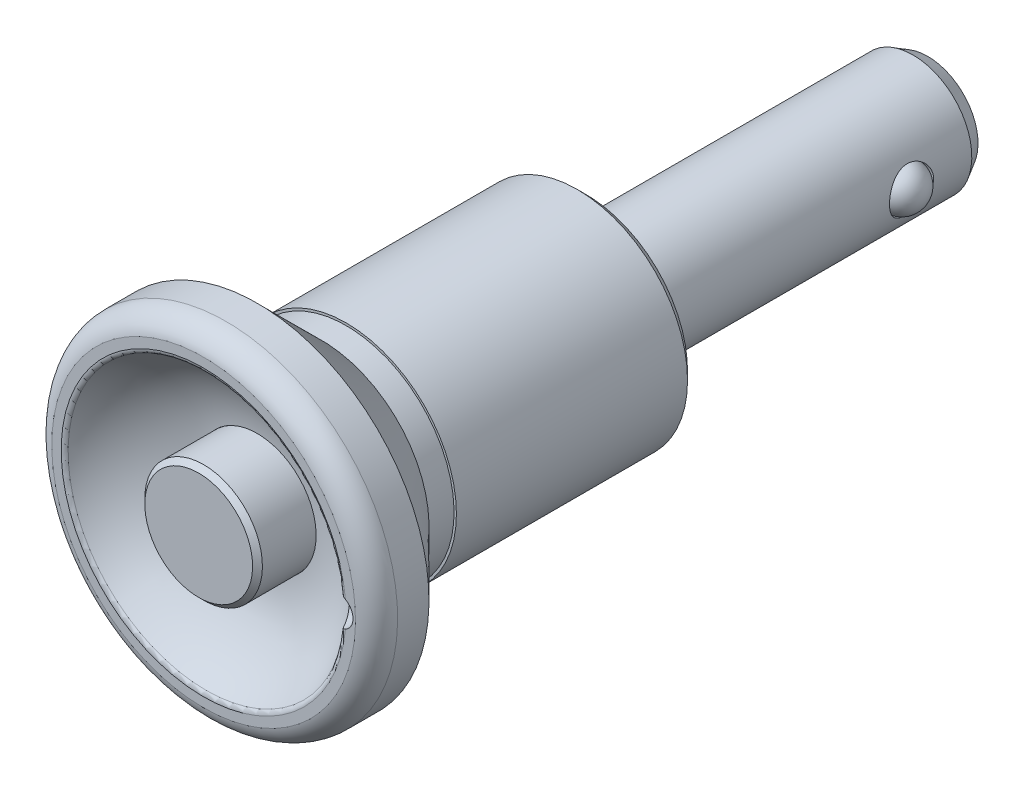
ISO-10303-21;
HEADER;
FILE_DESCRIPTION(('STEP AP214'),'2;1');
FILE_NAME('part.step','',(''),(''),'','','');
FILE_SCHEMA(('AUTOMOTIVE_DESIGN { 1 0 10303 214 1 1 1 1 }'));
ENDSEC;
DATA;
#1=APPLICATION_CONTEXT('core data for automotive mechanical design processes');
#2=APPLICATION_PROTOCOL_DEFINITION('international standard','automotive_design',2000,#1);
#3=PRODUCT_CONTEXT('',#1,'mechanical');
#4=PRODUCT('Part','Part','',(#3));
#5=PRODUCT_RELATED_PRODUCT_CATEGORY('part','',(#4));
#6=PRODUCT_DEFINITION_FORMATION('','',#4);
#7=PRODUCT_DEFINITION_CONTEXT('part definition',#1,'design');
#8=PRODUCT_DEFINITION('design','',#6,#7);
#9=PRODUCT_DEFINITION_SHAPE('','',#8);
#10=(LENGTH_UNIT() NAMED_UNIT(*) SI_UNIT(.MILLI.,.METRE.));
#11=(NAMED_UNIT(*) PLANE_ANGLE_UNIT() SI_UNIT($,.RADIAN.));
#12=(NAMED_UNIT(*) SI_UNIT($,.STERADIAN.) SOLID_ANGLE_UNIT());
#13=UNCERTAINTY_MEASURE_WITH_UNIT(LENGTH_MEASURE(1.E-05),#10,'distance_accuracy_value','');
#14=(GEOMETRIC_REPRESENTATION_CONTEXT(3) GLOBAL_UNCERTAINTY_ASSIGNED_CONTEXT((#13)) GLOBAL_UNIT_ASSIGNED_CONTEXT((#10,
#11,#12)) REPRESENTATION_CONTEXT('',''));
#15=CARTESIAN_POINT('',(0.,0.,0.));
#16=DIRECTION('',(0.,0.,1.));
#17=DIRECTION('',(1.,0.,0.));
#18=AXIS2_PLACEMENT_3D('',#15,#16,#17);
#19=CARTESIAN_POINT('',(0.,0.,-34.9));
#20=DIRECTION('',(0.,0.,-1.));
#21=DIRECTION('',(0.,1.,0.));
#22=AXIS2_PLACEMENT_3D('',#19,#20,#21);
#23=CYLINDRICAL_SURFACE('',#22,6.);
#24=CARTESIAN_POINT('',(-5.56214886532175,2.25,-27.25));
#25=CARTESIAN_POINT('',(-5.5621446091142,2.25000456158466,-27.1284887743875));
#26=CARTESIAN_POINT('',(-5.56617390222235,2.24012396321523,-27.0070076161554));
#27=CARTESIAN_POINT('',(-5.58174238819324,2.20104281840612,-26.7677078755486));
#28=CARTESIAN_POINT('',(-5.59328135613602,2.17184285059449,-26.6498891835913));
#29=CARTESIAN_POINT('',(-5.62238220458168,2.09534486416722,-26.4214369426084));
#30=CARTESIAN_POINT('',(-5.63992964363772,2.04809020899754,-26.3107869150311));
#31=CARTESIAN_POINT('',(-5.67904701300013,1.93697785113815,-26.098942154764));
#32=CARTESIAN_POINT('',(-5.70061815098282,1.87311516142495,-25.9977502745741));
#33=CARTESIAN_POINT('',(-5.74655362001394,1.7271999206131,-25.802664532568));
#34=CARTESIAN_POINT('',(-5.77100012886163,1.64445571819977,-25.7093072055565));
#35=CARTESIAN_POINT('',(-5.81924625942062,1.46459375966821,-25.5374157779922));
#36=CARTESIAN_POINT('',(-5.84304574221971,1.36747294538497,-25.4588848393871));
#37=CARTESIAN_POINT('',(-5.88829310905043,1.15754198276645,-25.3162907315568));
#38=CARTESIAN_POINT('',(-5.90963341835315,1.04431042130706,-25.2528107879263));
#39=CARTESIAN_POINT('',(-5.94657011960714,0.807833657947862,-25.1460232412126));
#40=CARTESIAN_POINT('',(-5.96216850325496,0.684591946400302,-25.102708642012));
#41=CARTESIAN_POINT('',(-5.98528045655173,0.437234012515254,-25.0393631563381));
#42=CARTESIAN_POINT('',(-5.99311372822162,0.313384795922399,-25.0184085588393));
#43=CARTESIAN_POINT('',(-6.0009602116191,0.063696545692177,-24.9974181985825));
#44=CARTESIAN_POINT('',(-6.00097596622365,-0.0621418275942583,-24.997375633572));
#45=CARTESIAN_POINT('',(-5.9933889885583,-0.305615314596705,-25.0176726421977));
#46=CARTESIAN_POINT('',(-5.9861631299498,-0.423348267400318,-25.0370039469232));
#47=CARTESIAN_POINT('',(-5.96539912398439,-0.653758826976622,-25.0938038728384));
#48=CARTESIAN_POINT('',(-5.95186052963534,-0.766436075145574,-25.1312737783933));
#49=CARTESIAN_POINT('',(-5.91956653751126,-0.985483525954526,-25.2237556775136));
#50=CARTESIAN_POINT('',(-5.90073809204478,-1.09173808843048,-25.2790150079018));
#51=CARTESIAN_POINT('',(-5.85976965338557,-1.29372991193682,-25.4052881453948));
#52=CARTESIAN_POINT('',(-5.83762859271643,-1.38946376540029,-25.4763070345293));
#53=CARTESIAN_POINT('',(-5.79078794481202,-1.57363573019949,-25.6369409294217));
#54=CARTESIAN_POINT('',(-5.76601445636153,-1.6613192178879,-25.727400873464));
#55=CARTESIAN_POINT('',(-5.71773690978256,-1.82055593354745,-25.921889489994));
#56=CARTESIAN_POINT('',(-5.69423317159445,-1.89210511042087,-26.0259215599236));
#57=CARTESIAN_POINT('',(-5.65069055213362,-2.01848417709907,-26.247579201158));
#58=CARTESIAN_POINT('',(-5.63074015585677,-2.07290771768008,-26.3654552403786));
#59=CARTESIAN_POINT('',(-5.59758657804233,-2.16084696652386,-26.6096443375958));
#60=CARTESIAN_POINT('',(-5.58437964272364,-2.19437430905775,-26.7359526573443));
#61=CARTESIAN_POINT('',(-5.56709395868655,-2.23785287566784,-26.9859639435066));
#62=CARTESIAN_POINT('',(-5.56255177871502,-2.24900281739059,-27.109426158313));
#63=CARTESIAN_POINT('',(-5.56179809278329,-2.25086828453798,-27.3565140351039));
#64=CARTESIAN_POINT('',(-5.56558450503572,-2.24158891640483,-27.4801396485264));
#65=CARTESIAN_POINT('',(-5.58059072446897,-2.20394600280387,-27.7178948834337));
#66=CARTESIAN_POINT('',(-5.59144914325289,-2.17650927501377,-27.8321967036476));
#67=CARTESIAN_POINT('',(-5.61894730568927,-2.10449661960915,-28.0545219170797));
#68=CARTESIAN_POINT('',(-5.63558823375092,-2.05991718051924,-28.1625440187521));
#69=CARTESIAN_POINT('',(-5.67354364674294,-1.95300438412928,-28.3737466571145));
#70=CARTESIAN_POINT('',(-5.69500993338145,-1.89006817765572,-28.4765939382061));
#71=CARTESIAN_POINT('',(-5.7399422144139,-1.74886976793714,-28.670693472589));
#72=CARTESIAN_POINT('',(-5.76340893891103,-1.67060195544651,-28.761941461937));
#73=CARTESIAN_POINT('',(-5.8114956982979,-1.49509101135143,-28.9362525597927));
#74=CARTESIAN_POINT('',(-5.83609454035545,-1.3969595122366,-29.0184301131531));
#75=CARTESIAN_POINT('',(-5.88224812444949,-1.18769620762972,-29.1652575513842));
#76=CARTESIAN_POINT('',(-5.90380285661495,-1.07656435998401,-29.2299073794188));
#77=CARTESIAN_POINT('',(-5.94142478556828,-0.844524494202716,-29.3394190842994));
#78=CARTESIAN_POINT('',(-5.95751072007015,-0.723651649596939,-29.3843486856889));
#79=CARTESIAN_POINT('',(-5.98244155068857,-0.475322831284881,-29.4529846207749));
#80=CARTESIAN_POINT('',(-5.99128984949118,-0.347869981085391,-29.4767009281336));
#81=CARTESIAN_POINT('',(-6.0004261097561,-0.0980033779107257,-29.5011616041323));
#82=CARTESIAN_POINT('',(-6.00118291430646,0.0242711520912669,-29.5031642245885));
#83=CARTESIAN_POINT('',(-5.99527334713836,0.267340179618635,-29.4873772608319));
#84=CARTESIAN_POINT('',(-5.98860787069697,0.388134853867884,-29.4695900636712));
#85=CARTESIAN_POINT('',(-5.96881634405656,0.621822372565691,-29.4156117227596));
#86=CARTESIAN_POINT('',(-5.95585187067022,0.734836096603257,-29.3798801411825));
#87=CARTESIAN_POINT('',(-5.92481675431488,0.953273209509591,-29.2914849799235));
#88=CARTESIAN_POINT('',(-5.90674514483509,1.05869515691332,-29.2388181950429));
#89=CARTESIAN_POINT('',(-5.86635927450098,1.26381026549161,-29.1155290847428));
#90=CARTESIAN_POINT('',(-5.8438986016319,1.36307632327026,-29.0442450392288));
#91=CARTESIAN_POINT('',(-5.79749261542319,1.54862602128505,-28.8867882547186));
#92=CARTESIAN_POINT('',(-5.77354677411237,1.63490500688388,-28.8006102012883));
#93=CARTESIAN_POINT('',(-5.72532194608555,1.7967182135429,-28.6104038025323));
#94=CARTESIAN_POINT('',(-5.70109208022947,1.87144499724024,-28.5056733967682));
#95=CARTESIAN_POINT('',(-5.65647487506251,2.00227064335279,-28.2843761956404));
#96=CARTESIAN_POINT('',(-5.6360879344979,2.05836757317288,-28.1678081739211));
#97=CARTESIAN_POINT('',(-5.60103404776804,2.15198830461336,-27.9205664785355));
#98=CARTESIAN_POINT('',(-5.58665704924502,2.18859004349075,-27.7894984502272));
#99=CARTESIAN_POINT('',(-5.56721991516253,2.23758535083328,-27.5222720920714));
#100=CARTESIAN_POINT('',(-5.56215363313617,2.24999489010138,-27.3861171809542));
#101=CARTESIAN_POINT('',(-5.56214886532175,2.25,-27.25));
#102=B_SPLINE_CURVE_WITH_KNOTS('',3,(#24,#25,#26,#27,#28,#29,#30,#31,#32,#33,#34,#35,#36,#37,
#38,#39,#40,#41,#42,#43,#44,#45,#46,#47,#48,#49,#50,#51,#52,#53,#54,#55,#56,#57,#58,#59,#60,#61,
#62,#63,#64,#65,#66,#67,#68,#69,#70,#71,#72,#73,#74,#75,#76,#77,#78,#79,#80,#81,#82,#83,#84,#85,
#86,#87,#88,#89,#90,#91,#92,#93,#94,#95,#96,#97,#98,#99,#100,#101),.UNSPECIFIED.,.T.,.F.,(4,2,2,
2,2,2,2,2,2,2,2,2,2,2,2,2,2,2,2,2,2,2,2,2,2,2,2,2,2,2,2,2,2,2,2,2,2,2,4),(0.,0.364026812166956,
0.728042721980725,1.09118978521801,1.45444601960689,1.83411978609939,2.2138744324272,
2.60655108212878,2.99909139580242,3.37470027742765,3.75018698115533,4.10709709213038,
4.4640324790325,4.82616196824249,5.1884084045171,5.57185012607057,5.95538801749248,
6.34743888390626,6.73927127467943,7.1094848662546,7.4796059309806,7.83215768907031,
8.18478170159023,8.55062341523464,8.91659922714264,9.30577525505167,9.69495254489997,
10.0827826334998,10.4704302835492,10.8354858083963,11.2004973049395,11.5566041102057,
11.9127783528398,12.2839248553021,12.6552040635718,13.0460789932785,13.436994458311,
13.8450476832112,14.2528314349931),.UNSPECIFIED.);
#103=CARTESIAN_POINT('',(-5.56214886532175,2.25,-27.25));
#104=VERTEX_POINT('',#103);
#105=EDGE_CURVE('E68',#104,#104,#102,.T.);
#106=ORIENTED_EDGE('',*,*,#105,.T.);
#107=EDGE_LOOP('',(#106));
#108=FACE_BOUND('',#107,.T.);
#109=CARTESIAN_POINT('',(0.,0.,-33.4));
#110=DIRECTION('',(0.,0.,-1.));
#111=DIRECTION('',(0.,1.,0.));
#112=AXIS2_PLACEMENT_3D('',#109,#110,#111);
#113=CIRCLE('',#112,6.);
#114=CARTESIAN_POINT('',(0.,6.,-33.4));
#115=VERTEX_POINT('',#114);
#116=EDGE_CURVE('E314',#115,#115,#113,.T.);
#117=ORIENTED_EDGE('',*,*,#116,.F.);
#118=EDGE_LOOP('',(#117));
#119=FACE_BOUND('',#118,.T.);
#120=CARTESIAN_POINT('',(5.56214886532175,2.25,-27.25));
#121=CARTESIAN_POINT('',(5.5621446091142,2.25000456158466,-27.3715112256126));
#122=CARTESIAN_POINT('',(5.56617390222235,2.24012396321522,-27.4929923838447));
#123=CARTESIAN_POINT('',(5.58174238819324,2.20104281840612,-27.7322921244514));
#124=CARTESIAN_POINT('',(5.59328135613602,2.17184285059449,-27.8501108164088));
#125=CARTESIAN_POINT('',(5.62238220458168,2.09534486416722,-28.0785630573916));
#126=CARTESIAN_POINT('',(5.63992964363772,2.04809020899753,-28.1892130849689));
#127=CARTESIAN_POINT('',(5.67904701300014,1.93697785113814,-28.401057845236));
#128=CARTESIAN_POINT('',(5.70061815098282,1.87311516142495,-28.5022497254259));
#129=CARTESIAN_POINT('',(5.74655362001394,1.7271999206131,-28.697335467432));
#130=CARTESIAN_POINT('',(5.77100012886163,1.64445571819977,-28.7906927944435));
#131=CARTESIAN_POINT('',(5.81924625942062,1.46459375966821,-28.9625842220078));
#132=CARTESIAN_POINT('',(5.84304574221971,1.36747294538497,-29.0411151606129));
#133=CARTESIAN_POINT('',(5.88829310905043,1.15754198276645,-29.1837092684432));
#134=CARTESIAN_POINT('',(5.90963341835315,1.04431042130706,-29.2471892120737));
#135=CARTESIAN_POINT('',(5.94657011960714,0.807833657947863,-29.3539767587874));
#136=CARTESIAN_POINT('',(5.96216850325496,0.684591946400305,-29.397291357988));
#137=CARTESIAN_POINT('',(5.98528045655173,0.437234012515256,-29.4606368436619));
#138=CARTESIAN_POINT('',(5.99311372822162,0.3133847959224,-29.4815914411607));
#139=CARTESIAN_POINT('',(6.0009602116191,0.0636965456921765,-29.5025818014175));
#140=CARTESIAN_POINT('',(6.00097596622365,-0.062141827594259,-29.502624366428));
#141=CARTESIAN_POINT('',(5.9933889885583,-0.305615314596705,-29.4823273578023));
#142=CARTESIAN_POINT('',(5.9861631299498,-0.423348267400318,-29.4629960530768));
#143=CARTESIAN_POINT('',(5.96539912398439,-0.653758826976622,-29.4061961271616));
#144=CARTESIAN_POINT('',(5.95186052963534,-0.766436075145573,-29.3687262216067));
#145=CARTESIAN_POINT('',(5.91956653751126,-0.985483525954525,-29.2762443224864));
#146=CARTESIAN_POINT('',(5.90073809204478,-1.09173808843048,-29.2209849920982));
#147=CARTESIAN_POINT('',(5.85976965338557,-1.29372991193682,-29.0947118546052));
#148=CARTESIAN_POINT('',(5.83762859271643,-1.38946376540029,-29.0236929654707));
#149=CARTESIAN_POINT('',(5.79078794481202,-1.57363573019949,-28.8630590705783));
#150=CARTESIAN_POINT('',(5.76601445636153,-1.6613192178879,-28.772599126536));
#151=CARTESIAN_POINT('',(5.71773690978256,-1.82055593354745,-28.578110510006));
#152=CARTESIAN_POINT('',(5.69423317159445,-1.89210511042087,-28.4740784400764));
#153=CARTESIAN_POINT('',(5.65069055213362,-2.01848417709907,-28.252420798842));
#154=CARTESIAN_POINT('',(5.63074015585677,-2.07290771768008,-28.1345447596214));
#155=CARTESIAN_POINT('',(5.59758657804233,-2.16084696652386,-27.8903556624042));
#156=CARTESIAN_POINT('',(5.58437964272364,-2.19437430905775,-27.7640473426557));
#157=CARTESIAN_POINT('',(5.56709395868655,-2.23785287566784,-27.5140360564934));
#158=CARTESIAN_POINT('',(5.56255177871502,-2.24900281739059,-27.3905738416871));
#159=CARTESIAN_POINT('',(5.56179809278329,-2.25086828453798,-27.1434859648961));
#160=CARTESIAN_POINT('',(5.56558450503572,-2.24158891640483,-27.0198603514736));
#161=CARTESIAN_POINT('',(5.58059072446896,-2.20394600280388,-26.7821051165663));
#162=CARTESIAN_POINT('',(5.59144914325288,-2.17650927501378,-26.6678032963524));
#163=CARTESIAN_POINT('',(5.61894730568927,-2.10449661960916,-26.4454780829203));
#164=CARTESIAN_POINT('',(5.63558823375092,-2.05991718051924,-26.337455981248));
#165=CARTESIAN_POINT('',(5.67354364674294,-1.95300438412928,-26.1262533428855));
#166=CARTESIAN_POINT('',(5.69500993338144,-1.89006817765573,-26.023406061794));
#167=CARTESIAN_POINT('',(5.7399422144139,-1.74886976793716,-25.829306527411));
#168=CARTESIAN_POINT('',(5.76340893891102,-1.67060195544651,-25.7380585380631));
#169=CARTESIAN_POINT('',(5.8114956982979,-1.49509101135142,-25.5637474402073));
#170=CARTESIAN_POINT('',(5.83609454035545,-1.39695951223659,-25.4815698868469));
#171=CARTESIAN_POINT('',(5.88224812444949,-1.18769620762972,-25.3347424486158));
#172=CARTESIAN_POINT('',(5.90380285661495,-1.07656435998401,-25.2700926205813));
#173=CARTESIAN_POINT('',(5.94142478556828,-0.844524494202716,-25.1605809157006));
#174=CARTESIAN_POINT('',(5.95751072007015,-0.723651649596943,-25.1156513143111));
#175=CARTESIAN_POINT('',(5.98244155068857,-0.475322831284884,-25.0470153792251));
#176=CARTESIAN_POINT('',(5.99128984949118,-0.34786998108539,-25.0232990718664));
#177=CARTESIAN_POINT('',(6.0004261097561,-0.0980033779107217,-24.9988383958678));
#178=CARTESIAN_POINT('',(6.00118291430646,0.0242711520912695,-24.9968357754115));
#179=CARTESIAN_POINT('',(5.99527334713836,0.267340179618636,-25.0126227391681));
#180=CARTESIAN_POINT('',(5.98860787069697,0.388134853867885,-25.0304099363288));
#181=CARTESIAN_POINT('',(5.96881634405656,0.621822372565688,-25.0843882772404));
#182=CARTESIAN_POINT('',(5.95585187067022,0.734836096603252,-25.1201198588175));
#183=CARTESIAN_POINT('',(5.92481675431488,0.953273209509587,-25.2085150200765));
#184=CARTESIAN_POINT('',(5.90674514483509,1.05869515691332,-25.2611818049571));
#185=CARTESIAN_POINT('',(5.86635927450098,1.26381026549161,-25.3844709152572));
#186=CARTESIAN_POINT('',(5.8438986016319,1.36307632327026,-25.4557549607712));
#187=CARTESIAN_POINT('',(5.79749261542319,1.54862602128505,-25.6132117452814));
#188=CARTESIAN_POINT('',(5.77354677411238,1.63490500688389,-25.6993897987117));
#189=CARTESIAN_POINT('',(5.72532194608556,1.7967182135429,-25.8895961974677));
#190=CARTESIAN_POINT('',(5.70109208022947,1.87144499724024,-25.9943266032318));
#191=CARTESIAN_POINT('',(5.6564748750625,2.00227064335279,-26.2156238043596));
#192=CARTESIAN_POINT('',(5.63608793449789,2.05836757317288,-26.3321918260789));
#193=CARTESIAN_POINT('',(5.60103404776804,2.15198830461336,-26.5794335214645));
#194=CARTESIAN_POINT('',(5.58665704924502,2.18859004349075,-26.7105015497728));
#195=CARTESIAN_POINT('',(5.56721991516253,2.23758535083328,-26.9777279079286));
#196=CARTESIAN_POINT('',(5.56215363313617,2.24999489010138,-27.1138828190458));
#197=CARTESIAN_POINT('',(5.56214886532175,2.25,-27.25));
#198=B_SPLINE_CURVE_WITH_KNOTS('',3,(#120,#121,#122,#123,#124,#125,#126,#127,#128,#129,#130,
#131,#132,#133,#134,#135,#136,#137,#138,#139,#140,#141,#142,#143,#144,#145,#146,#147,#148,#149,
#150,#151,#152,#153,#154,#155,#156,#157,#158,#159,#160,#161,#162,#163,#164,#165,#166,#167,#168,
#169,#170,#171,#172,#173,#174,#175,#176,#177,#178,#179,#180,#181,#182,#183,#184,#185,#186,#187,
#188,#189,#190,#191,#192,#193,#194,#195,#196,#197),.UNSPECIFIED.,.T.,.F.,(4,2,2,2,2,2,2,2,2,2,2,
2,2,2,2,2,2,2,2,2,2,2,2,2,2,2,2,2,2,2,2,2,2,2,2,2,2,2,4),(0.,0.364026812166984,
0.728042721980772,1.09118978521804,1.45444601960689,1.83411978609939,2.2138744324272,
2.60655108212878,2.99909139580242,3.37470027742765,3.75018698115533,4.10709709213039,
4.46403247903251,4.82616196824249,5.1884084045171,5.57185012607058,5.95538801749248,
6.34743888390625,6.73927127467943,7.10948486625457,7.47960593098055,7.83215768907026,
8.18478170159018,8.55062341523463,8.91659922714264,9.30577525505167,9.69495254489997,
10.0827826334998,10.4704302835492,10.8354858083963,11.2004973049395,11.5566041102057,
11.9127783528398,12.2839248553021,12.6552040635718,13.0460789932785,13.4369944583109,
13.8450476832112,14.2528314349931),.UNSPECIFIED.);
#199=CARTESIAN_POINT('',(5.56214886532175,2.25,-27.25));
#200=VERTEX_POINT('',#199);
#201=EDGE_CURVE('E292',#200,#200,#198,.T.);
#202=ORIENTED_EDGE('',*,*,#201,.T.);
#203=EDGE_LOOP('',(#202));
#204=FACE_BOUND('',#203,.T.);
#205=CARTESIAN_POINT('',(0.,0.,0.));
#206=DIRECTION('',(0.,0.,1.));
#207=DIRECTION('',(1.,0.,0.));
#208=AXIS2_PLACEMENT_3D('',#205,#206,#207);
#209=CIRCLE('',#208,6.);
#210=CARTESIAN_POINT('',(6.,0.,0.));
#211=VERTEX_POINT('',#210);
#212=EDGE_CURVE('E80',#211,#211,#209,.T.);
#213=ORIENTED_EDGE('',*,*,#212,.F.);
#214=EDGE_LOOP('',(#213));
#215=FACE_BOUND('',#214,.T.);
#216=ADVANCED_FACE('F14',(#108,#119,#204,#215),#23,.T.);
#217=CARTESIAN_POINT('',(0.,0.,-34.9));
#218=DIRECTION('',(0.,0.,-1.));
#219=DIRECTION('',(0.,1.,0.));
#220=AXIS2_PLACEMENT_3D('',#217,#218,#219);
#221=CYLINDRICAL_SURFACE('',#220,2.75);
#222=CARTESIAN_POINT('',(0.,0.,-29.5));
#223=DIRECTION('',(0.,0.,-1.));
#224=DIRECTION('',(0.,1.,0.));
#225=AXIS2_PLACEMENT_3D('',#222,#223,#224);
#226=CIRCLE('',#225,2.75);
#227=CARTESIAN_POINT('',(0.,2.75,-29.5));
#228=VERTEX_POINT('',#227);
#229=EDGE_CURVE('E74',#228,#228,#226,.T.);
#230=ORIENTED_EDGE('',*,*,#229,.F.);
#231=EDGE_LOOP('',(#230));
#232=FACE_BOUND('',#231,.T.);
#233=CARTESIAN_POINT('',(0.,0.,-34.9));
#234=DIRECTION('',(0.,0.,-1.));
#235=DIRECTION('',(0.,1.,0.));
#236=AXIS2_PLACEMENT_3D('',#233,#234,#235);
#237=CIRCLE('',#236,2.75);
#238=CARTESIAN_POINT('',(0.,2.75,-34.9));
#239=VERTEX_POINT('',#238);
#240=EDGE_CURVE('E306',#239,#239,#237,.T.);
#241=ORIENTED_EDGE('',*,*,#240,.T.);
#242=EDGE_LOOP('',(#241));
#243=FACE_BOUND('',#242,.T.);
#244=ADVANCED_FACE('F273',(#232,#243),#221,.F.);
#245=CARTESIAN_POINT('',(2.75,0.,-34.9));
#246=DIRECTION('',(0.,0.,-1.));
#247=DIRECTION('',(0.,1.,0.));
#248=AXIS2_PLACEMENT_3D('',#245,#246,#247);
#249=PLANE('',#248);
#250=CARTESIAN_POINT('',(0.,0.,-34.9));
#251=DIRECTION('',(0.,0.,-1.));
#252=DIRECTION('',(0.,1.,0.));
#253=AXIS2_PLACEMENT_3D('',#250,#251,#252);
#254=CIRCLE('',#253,5.13397459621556);
#255=CARTESIAN_POINT('',(0.,5.13397459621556,-34.9));
#256=VERTEX_POINT('',#255);
#257=EDGE_CURVE('E310',#256,#256,#254,.T.);
#258=ORIENTED_EDGE('',*,*,#257,.T.);
#259=EDGE_LOOP('',(#258));
#260=FACE_BOUND('',#259,.T.);
#261=ORIENTED_EDGE('',*,*,#240,.F.);
#262=EDGE_LOOP('',(#261));
#263=FACE_BOUND('',#262,.T.);
#264=ADVANCED_FACE('F280',(#260,#263),#249,.T.);
#265=CARTESIAN_POINT('',(0.,0.,-34.9));
#266=DIRECTION('',(0.,0.,1.));
#267=DIRECTION('',(0.,-1.,0.));
#268=AXIS2_PLACEMENT_3D('',#265,#266,#267);
#269=CONICAL_SURFACE('',#268,5.13397459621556,0.523598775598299);
#270=ORIENTED_EDGE('',*,*,#116,.T.);
#271=EDGE_LOOP('',(#270));
#272=FACE_BOUND('',#271,.T.);
#273=ORIENTED_EDGE('',*,*,#257,.F.);
#274=EDGE_LOOP('',(#273));
#275=FACE_BOUND('',#274,.T.);
#276=ADVANCED_FACE('F288',(#272,#275),#269,.T.);
#277=CARTESIAN_POINT('',(7.,0.,-27.25));
#278=DIRECTION('',(1.,0.,0.));
#279=DIRECTION('',(0.,1.,0.));
#280=AXIS2_PLACEMENT_3D('',#277,#278,#279);
#281=CYLINDRICAL_SURFACE('',#280,2.25);
#282=CARTESIAN_POINT('',(4.70120856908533,2.25,-27.25));
#283=CARTESIAN_POINT('',(4.70121469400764,2.24999417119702,-27.1304590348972));
#284=CARTESIAN_POINT('',(4.70583400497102,2.24041261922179,-27.0107125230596));
#285=CARTESIAN_POINT('',(4.72369711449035,2.20249080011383,-26.7747180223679));
#286=CARTESIAN_POINT('',(4.73696351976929,2.17410135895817,-26.6584800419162));
#287=CARTESIAN_POINT('',(4.77031963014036,2.09989154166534,-26.4333349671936));
#288=CARTESIAN_POINT('',(4.79038009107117,2.05414577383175,-26.324398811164));
#289=CARTESIAN_POINT('',(4.83501981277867,1.94674472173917,-26.1157771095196));
#290=CARTESIAN_POINT('',(4.85959823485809,1.88509238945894,-26.016089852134));
#291=CARTESIAN_POINT('',(4.91234222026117,1.74321937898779,-25.8220680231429));
#292=CARTESIAN_POINT('',(4.94063496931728,1.66209866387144,-25.7284258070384));
#293=CARTESIAN_POINT('',(4.99657815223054,1.48547872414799,-25.5555585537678));
#294=CARTESIAN_POINT('',(5.02422832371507,1.38997374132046,-25.4763393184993));
#295=CARTESIAN_POINT('',(5.07733633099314,1.18176930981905,-25.3309420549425));
#296=CARTESIAN_POINT('',(5.10262925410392,1.06847133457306,-25.2655553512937));
#297=CARTESIAN_POINT('',(5.14660113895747,0.831192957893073,-25.1550726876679));
#298=CARTESIAN_POINT('',(5.16528324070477,0.707217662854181,-25.1099670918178));
#299=CARTESIAN_POINT('',(5.1930243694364,0.459385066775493,-25.0438746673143));
#300=CARTESIAN_POINT('',(5.20255899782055,0.335901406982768,-25.0216905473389));
#301=CARTESIAN_POINT('',(5.21266651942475,0.0866213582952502,-24.9981895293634));
#302=CARTESIAN_POINT('',(5.21324333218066,-0.0391739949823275,-24.9968635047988));
#303=CARTESIAN_POINT('',(5.20564133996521,-0.280752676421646,-25.0145162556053));
#304=CARTESIAN_POINT('',(5.19803132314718,-0.396653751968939,-25.0321759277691));
#305=CARTESIAN_POINT('',(5.17570524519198,-0.623658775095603,-25.0850210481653));
#306=CARTESIAN_POINT('',(5.16098865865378,-0.734762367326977,-25.1202077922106));
#307=CARTESIAN_POINT('',(5.12557562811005,-0.951074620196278,-25.2075078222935));
#308=CARTESIAN_POINT('',(5.10479112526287,-1.05616705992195,-25.2598718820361));
#309=CARTESIAN_POINT('',(5.05924909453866,-1.25634985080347,-25.3797828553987));
#310=CARTESIAN_POINT('',(5.03449013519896,-1.35143657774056,-25.4473352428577));
#311=CARTESIAN_POINT('',(4.9812692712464,-1.53647964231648,-25.6015757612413));
#312=CARTESIAN_POINT('',(4.95266891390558,-1.6255187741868,-25.689317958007));
#313=CARTESIAN_POINT('',(4.89634671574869,-1.7880335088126,-25.8785052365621));
#314=CARTESIAN_POINT('',(4.8686252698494,-1.86150219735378,-25.9799563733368));
#315=CARTESIAN_POINT('',(4.81616806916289,-1.99339518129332,-26.1984520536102));
#316=CARTESIAN_POINT('',(4.79158303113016,-2.05115292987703,-26.3159383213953));
#317=CARTESIAN_POINT('',(4.75001097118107,-2.14568300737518,-26.5603104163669));
#318=CARTESIAN_POINT('',(4.73301805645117,-2.18247161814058,-26.6871888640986));
#319=CARTESIAN_POINT('',(4.7100473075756,-2.23159308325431,-26.9375319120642));
#320=CARTESIAN_POINT('',(4.70339790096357,-2.24542132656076,-27.0606401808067));
#321=CARTESIAN_POINT('',(4.69994279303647,-2.25264846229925,-27.3075714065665));
#322=CARTESIAN_POINT('',(4.70313324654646,-2.24605533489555,-27.4313940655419));
#323=CARTESIAN_POINT('',(4.71830050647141,-2.21399394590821,-27.6669653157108));
#324=CARTESIAN_POINT('',(4.72963794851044,-2.18989787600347,-27.778947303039));
#325=CARTESIAN_POINT('',(4.75898261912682,-2.12536894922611,-27.9971687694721));
#326=CARTESIAN_POINT('',(4.77699148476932,-2.08493208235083,-28.1034068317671));
#327=CARTESIAN_POINT('',(4.81860535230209,-1.98691927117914,-28.3123309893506));
#328=CARTESIAN_POINT('',(4.8424207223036,-1.92867086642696,-28.414658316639));
#329=CARTESIAN_POINT('',(4.89268495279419,-1.79734114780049,-28.6086003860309));
#330=CARTESIAN_POINT('',(4.91913500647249,-1.72425309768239,-28.7002102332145));
#331=CARTESIAN_POINT('',(4.97451487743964,-1.5576964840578,-28.8785741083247));
#332=CARTESIAN_POINT('',(5.00345675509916,-1.46299589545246,-28.9641786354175));
#333=CARTESIAN_POINT('',(5.05840859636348,-1.25992784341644,-29.11851397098));
#334=CARTESIAN_POINT('',(5.0844182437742,-1.15155890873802,-29.1872429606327));
#335=CARTESIAN_POINT('',(5.13083610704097,-0.92305594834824,-29.3059980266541));
#336=CARTESIAN_POINT('',(5.15121223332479,-0.802859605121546,-29.3559175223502));
#337=CARTESIAN_POINT('',(5.18380508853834,-0.5546620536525,-29.4344361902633));
#338=CARTESIAN_POINT('',(5.19602706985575,-0.426665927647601,-29.4630490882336));
#339=CARTESIAN_POINT('',(5.21029045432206,-0.176736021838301,-29.4963229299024));
#340=CARTESIAN_POINT('',(5.21301888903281,-0.0550554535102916,-29.5026010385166));
#341=CARTESIAN_POINT('',(5.20993078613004,0.187600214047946,-29.495446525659));
#342=CARTESIAN_POINT('',(5.2041159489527,0.308575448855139,-29.4820178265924));
#343=CARTESIAN_POINT('',(5.18496872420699,0.541359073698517,-29.436990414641));
#344=CARTESIAN_POINT('',(5.17194743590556,0.653340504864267,-29.4061426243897));
#345=CARTESIAN_POINT('',(5.13986314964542,0.870473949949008,-29.3280030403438));
#346=CARTESIAN_POINT('',(5.12079904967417,0.975624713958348,-29.2807082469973));
#347=CARTESIAN_POINT('',(5.07736891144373,1.18141977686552,-29.1686191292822));
#348=CARTESIAN_POINT('',(5.05280038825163,1.28163851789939,-29.1031238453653));
#349=CARTESIAN_POINT('',(5.00122306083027,1.47009921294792,-28.957485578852));
#350=CARTESIAN_POINT('',(4.9742132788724,1.5583363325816,-28.877336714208));
#351=CARTESIAN_POINT('',(4.9182708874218,1.72712341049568,-28.6976966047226));
#352=CARTESIAN_POINT('',(4.88934356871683,1.80662459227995,-28.5972140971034));
#353=CARTESIAN_POINT('',(4.83482876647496,1.94782882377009,-28.3835276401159));
#354=CARTESIAN_POINT('',(4.80924325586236,2.00952138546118,-28.270316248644));
#355=CARTESIAN_POINT('',(4.76470338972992,2.11297708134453,-28.0338474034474));
#356=CARTESIAN_POINT('',(4.74574393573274,2.15475554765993,-27.9105977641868));
#357=CARTESIAN_POINT('',(4.72435108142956,2.20105394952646,-27.7212685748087));
#358=CARTESIAN_POINT('',(4.71839681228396,2.21375426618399,-27.6574783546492));
#359=CARTESIAN_POINT('',(4.70903769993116,2.23359624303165,-27.5288695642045));
#360=CARTESIAN_POINT('',(4.70563091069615,2.2407421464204,-27.4640518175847));
#361=CARTESIAN_POINT('',(4.7027842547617,2.24670526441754,-27.3742341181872));
#362=CARTESIAN_POINT('',(4.7021941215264,2.24794009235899,-27.3494079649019));
#363=CARTESIAN_POINT('',(4.70140563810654,2.24958807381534,-27.2997241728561));
#364=CARTESIAN_POINT('',(4.70120729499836,2.25000121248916,-27.2748665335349));
#365=CARTESIAN_POINT('',(4.70120856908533,2.25,-27.25));
#366=B_SPLINE_CURVE_WITH_KNOTS('',3,(#282,#283,#284,#285,#286,#287,#288,#289,#290,#291,#292,
#293,#294,#295,#296,#297,#298,#299,#300,#301,#302,#303,#304,#305,#306,#307,#308,#309,#310,#311,
#312,#313,#314,#315,#316,#317,#318,#319,#320,#321,#322,#323,#324,#325,#326,#327,#328,#329,#330,
#331,#332,#333,#334,#335,#336,#337,#338,#339,#340,#341,#342,#343,#344,#345,#346,#347,#348,#349,
#350,#351,#352,#353,#354,#355,#356,#357,#358,#359,#360,#361,#362,#363,#364,#365),.UNSPECIFIED.,
.T.,.F.,(4,2,2,2,2,2,2,2,2,2,2,2,2,2,2,2,2,2,2,2,2,2,2,2,2,2,2,2,2,2,2,2,2,2,2,2,2,2,2,2,2,4),
(0.,0.358523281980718,0.717987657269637,1.07592402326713,1.43379401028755,1.81338979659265,
2.19313794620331,2.59079710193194,2.98826712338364,3.36372670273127,3.73902199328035,
4.08983186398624,4.4406676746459,4.79687203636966,5.15320497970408,5.53621810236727,
5.91940095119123,6.31693575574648,6.71416146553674,7.08432459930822,7.45434310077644,
7.79811230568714,8.14196592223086,8.50086375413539,8.85992486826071,9.25080120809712,
9.64171965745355,10.0348210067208,10.427668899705,10.7914180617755,11.1550948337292,
11.5041747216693,11.8533183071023,12.2184179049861,12.583664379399,12.9758816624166,
13.3683294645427,13.7604746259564,13.9561801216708,14.1517359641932,14.2263134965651,
14.3008923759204),.UNSPECIFIED.);
#367=CARTESIAN_POINT('',(4.84677342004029,1.91641577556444,-28.4289192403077));
#368=VERTEX_POINT('',#367);
#369=CARTESIAN_POINT('',(4.84677342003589,-1.91641577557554,-28.4289192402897));
#370=VERTEX_POINT('',#369);
#371=EDGE_CURVE('E70',#368,#370,#366,.T.);
#372=ORIENTED_EDGE('',*,*,#371,.F.);
#373=CARTESIAN_POINT('',(5.21189620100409,0.,-29.5));
#374=CARTESIAN_POINT('',(5.21189615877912,0.126284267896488,-29.4999948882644));
#375=CARTESIAN_POINT('',(5.21139467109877,0.252644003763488,-29.4893340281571));
#376=CARTESIAN_POINT('',(5.20938058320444,0.501864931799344,-29.4469613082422));
#377=CARTESIAN_POINT('',(5.20786696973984,0.624722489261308,-29.4152283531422));
#378=CARTESIAN_POINT('',(5.20380519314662,0.863320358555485,-29.3316208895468));
#379=CARTESIAN_POINT('',(5.20125743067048,0.97906340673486,-29.2797541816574));
#380=CARTESIAN_POINT('',(5.19508229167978,1.20015943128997,-29.1573752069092));
#381=CARTESIAN_POINT('',(5.19145518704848,1.30551501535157,-29.0868676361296));
#382=CARTESIAN_POINT('',(5.18303472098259,1.50291352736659,-28.9291996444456));
#383=CARTESIAN_POINT('',(5.17824107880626,1.59495324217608,-28.8420352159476));
#384=CARTESIAN_POINT('',(5.16733442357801,1.76311423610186,-28.653525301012));
#385=CARTESIAN_POINT('',(5.1612210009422,1.83923055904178,-28.5521754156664));
#386=CARTESIAN_POINT('',(5.14734400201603,1.97343552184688,-28.3381336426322));
#387=CARTESIAN_POINT('',(5.13957863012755,2.03150437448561,-28.2254294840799));
#388=CARTESIAN_POINT('',(5.12176723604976,2.1278284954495,-27.9921124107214));
#389=CARTESIAN_POINT('',(5.111724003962,2.1661078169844,-27.8715092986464));
#390=CARTESIAN_POINT('',(5.0933054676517,2.2077406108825,-27.6884429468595));
#391=CARTESIAN_POINT('',(5.08666779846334,2.21896106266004,-27.6275162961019));
#392=CARTESIAN_POINT('',(5.07117135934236,2.23631965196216,-27.5053136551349));
#393=CARTESIAN_POINT('',(5.06231462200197,2.24246241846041,-27.444038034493));
#394=CARTESIAN_POINT('',(5.04473959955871,2.24786649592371,-27.3524947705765));
#395=CARTESIAN_POINT('',(5.03817832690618,2.24903385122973,-27.3220839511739));
#396=CARTESIAN_POINT('',(5.02487846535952,2.24972982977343,-27.2856268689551));
#397=CARTESIAN_POINT('',(5.02196282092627,2.24983087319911,-27.278411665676));
#398=CARTESIAN_POINT('',(5.01679668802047,2.24992122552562,-27.2690075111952));
#399=CARTESIAN_POINT('',(5.01524668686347,2.24994100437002,-27.266465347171));
#400=CARTESIAN_POINT('',(5.01258312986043,2.24996347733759,-27.2628773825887));
#401=CARTESIAN_POINT('',(5.01163231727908,2.24996978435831,-27.2617128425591));
#402=CARTESIAN_POINT('',(5.00957474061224,2.24998007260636,-27.2595306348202));
#403=CARTESIAN_POINT('',(5.00846878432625,2.24998406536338,-27.258512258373));
#404=CARTESIAN_POINT('',(5.0067156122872,2.2499883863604,-27.2572404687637));
#405=CARTESIAN_POINT('',(5.00615104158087,2.2499895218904,-27.2568745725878));
#406=CARTESIAN_POINT('',(5.00497729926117,2.2499914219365,-27.2562214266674));
#407=CARTESIAN_POINT('',(5.00436814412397,2.24999218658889,-27.2559341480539));
#408=CARTESIAN_POINT('',(5.00310140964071,2.24999338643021,-27.2554607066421));
#409=CARTESIAN_POINT('',(5.00244330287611,2.24999381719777,-27.2552759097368));
#410=CARTESIAN_POINT('',(5.0011038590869,2.24999436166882,-27.2550386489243));
#411=CARTESIAN_POINT('',(5.00042256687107,2.24999447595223,-27.2549859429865));
#412=CARTESIAN_POINT('',(4.99914424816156,2.24999440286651,-27.2550185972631));
#413=CARTESIAN_POINT('',(4.99854676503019,2.24999424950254,-27.2550883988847));
#414=CARTESIAN_POINT('',(4.99737209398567,2.24999369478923,-27.2553279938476));
#415=CARTESIAN_POINT('',(4.99679493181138,2.24999329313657,-27.2554979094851));
#416=CARTESIAN_POINT('',(4.99546550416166,2.24999202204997,-27.2559985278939));
#417=CARTESIAN_POINT('',(4.99472705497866,2.24999103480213,-27.2563654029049));
#418=CARTESIAN_POINT('',(4.99331619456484,2.24998849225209,-27.2572086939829));
#419=CARTESIAN_POINT('',(4.99264394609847,2.24998693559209,-27.257685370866));
#420=CARTESIAN_POINT('',(4.9907978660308,2.24998155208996,-27.2591607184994));
#421=CARTESIAN_POINT('',(4.98969889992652,2.24997693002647,-27.2602516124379));
#422=CARTESIAN_POINT('',(4.98765562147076,2.24996520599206,-27.2625688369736));
#423=CARTESIAN_POINT('',(4.98671188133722,2.249958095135,-27.2637956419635));
#424=CARTESIAN_POINT('',(4.98193653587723,2.2499128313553,-27.2705312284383));
#425=CARTESIAN_POINT('',(4.97899990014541,2.24985038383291,-27.2766418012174));
#426=CARTESIAN_POINT('',(4.9737692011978,2.24966896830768,-27.2891278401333));
#427=CARTESIAN_POINT('',(4.9714820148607,2.24954942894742,-27.2955053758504));
#428=CARTESIAN_POINT('',(4.96106149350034,2.24881762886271,-27.3271058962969));
#429=CARTESIAN_POINT('',(4.9553081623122,2.24778447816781,-27.3531043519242));
#430=CARTESIAN_POINT('',(4.94501184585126,2.24479018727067,-27.4053004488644));
#431=CARTESIAN_POINT('',(4.94047527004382,2.24282427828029,-27.4314984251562));
#432=CARTESIAN_POINT('',(4.92798476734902,2.23550007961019,-27.5104298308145));
#433=CARTESIAN_POINT('',(4.92120435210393,2.22872063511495,-27.5632520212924));
#434=CARTESIAN_POINT('',(4.90891131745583,2.21142389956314,-27.6682645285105));
#435=CARTESIAN_POINT('',(4.90339617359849,2.20091415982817,-27.7204559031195));
#436=CARTESIAN_POINT('',(4.88803764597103,2.1637301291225,-27.8762327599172));
#437=CARTESIAN_POINT('',(4.87942579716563,2.13143364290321,-27.9786677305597));
#438=CARTESIAN_POINT('',(4.86395279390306,2.05263870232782,-28.1776953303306));
#439=CARTESIAN_POINT('',(4.8570871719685,2.00617717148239,-28.2743023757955));
#440=CARTESIAN_POINT('',(4.84463430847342,1.89998698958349,-28.4599495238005));
#441=CARTESIAN_POINT('',(4.83904642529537,1.84026502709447,-28.5489934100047));
#442=CARTESIAN_POINT('',(4.82796886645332,1.69683921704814,-28.7329593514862));
#443=CARTESIAN_POINT('',(4.82267830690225,1.61075316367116,-28.8260495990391));
#444=CARTESIAN_POINT('',(4.81331124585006,1.42411005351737,-28.9965405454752));
#445=CARTESIAN_POINT('',(4.80923548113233,1.32354426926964,-29.0739317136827));
#446=CARTESIAN_POINT('',(4.80219403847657,1.11084101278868,-29.2107437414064));
#447=CARTESIAN_POINT('',(4.79922814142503,0.998705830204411,-29.270168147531));
#448=CARTESIAN_POINT('',(4.79434733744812,0.766047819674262,-29.3693541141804));
#449=CARTESIAN_POINT('',(4.7924323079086,0.645525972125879,-29.4091179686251));
#450=CARTESIAN_POINT('',(4.78962227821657,0.399571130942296,-29.4678412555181));
#451=CARTESIAN_POINT('',(4.78872674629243,0.27414073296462,-29.4868115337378));
#452=CARTESIAN_POINT('',(4.78794106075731,0.0218703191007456,-29.5034420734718));
#453=CARTESIAN_POINT('',(4.78805091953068,-0.104969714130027,-29.5011020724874));
#454=CARTESIAN_POINT('',(4.78927737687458,-0.356418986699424,-29.4751821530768));
#455=CARTESIAN_POINT('',(4.79039368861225,-0.481028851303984,-29.4516082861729));
#456=CARTESIAN_POINT('',(4.79364906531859,-0.724519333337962,-29.3839024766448));
#457=CARTESIAN_POINT('',(4.79578813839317,-0.84339990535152,-29.3397703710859));
#458=CARTESIAN_POINT('',(4.80112512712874,-1.07207309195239,-29.2322025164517));
#459=CARTESIAN_POINT('',(4.80432317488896,-1.18186457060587,-29.1687643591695));
#460=CARTESIAN_POINT('',(4.81184515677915,-1.38922597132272,-29.0244041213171));
#461=CARTESIAN_POINT('',(4.81616903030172,-1.48679655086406,-28.9434829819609));
#462=CARTESIAN_POINT('',(4.82606445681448,-1.66699500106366,-28.7664389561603));
#463=CARTESIAN_POINT('',(4.83163644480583,-1.749617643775,-28.6703107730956));
#464=CARTESIAN_POINT('',(4.84427017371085,-1.89756793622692,-28.465602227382));
#465=CARTESIAN_POINT('',(4.85133233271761,-1.96289072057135,-28.3570183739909));
#466=CARTESIAN_POINT('',(4.86742332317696,-2.07443577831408,-28.1304409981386));
#467=CARTESIAN_POINT('',(4.8764541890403,-2.12063814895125,-28.0124378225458));
#468=CARTESIAN_POINT('',(4.89787609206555,-2.19253624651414,-27.7707327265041));
#469=CARTESIAN_POINT('',(4.9102638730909,-2.2182517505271,-27.6470364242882));
#470=CARTESIAN_POINT('',(4.93489152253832,-2.24079197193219,-27.4621887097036));
#471=CARTESIAN_POINT('',(4.9439209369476,-2.24567525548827,-27.4016395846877));
#472=CARTESIAN_POINT('',(4.96144377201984,-2.24865520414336,-27.3288938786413));
#473=CARTESIAN_POINT('',(4.96488235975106,-2.24907569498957,-27.3157504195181));
#474=CARTESIAN_POINT('',(4.97117438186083,-2.24953233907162,-27.2963421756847));
#475=CARTESIAN_POINT('',(4.97347535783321,-2.24965571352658,-27.2898919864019));
#476=CARTESIAN_POINT('',(4.97872381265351,-2.2498436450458,-27.277231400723));
#477=CARTESIAN_POINT('',(4.98166680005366,-2.24990859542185,-27.2710196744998));
#478=CARTESIAN_POINT('',(4.98649447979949,-2.24995636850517,-27.264083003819));
#479=CARTESIAN_POINT('',(4.98748893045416,-2.24996411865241,-27.2627698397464));
#480=CARTESIAN_POINT('',(4.98964936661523,-2.24997676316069,-27.2602966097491));
#481=CARTESIAN_POINT('',(4.99081420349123,-2.24998167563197,-27.2591356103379));
#482=CARTESIAN_POINT('',(4.99264559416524,-2.24998690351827,-27.2576897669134));
#483=CARTESIAN_POINT('',(4.9932154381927,-2.24998824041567,-27.2572839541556));
#484=CARTESIAN_POINT('',(4.9944037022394,-2.24999050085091,-27.2565481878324));
#485=CARTESIAN_POINT('',(4.99502214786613,-2.24999142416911,-27.2562182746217));
#486=CARTESIAN_POINT('',(4.99631433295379,-2.24999290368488,-27.2556581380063));
#487=CARTESIAN_POINT('',(4.99698872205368,-2.24999345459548,-27.2554293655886));
#488=CARTESIAN_POINT('',(4.99836895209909,-2.24999420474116,-27.2551094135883));
#489=CARTESIAN_POINT('',(4.99907470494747,-2.24999440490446,-27.2550178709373));
#490=CARTESIAN_POINT('',(5.00040115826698,-2.24999446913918,-27.2549888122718));
#491=CARTESIAN_POINT('',(5.00102150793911,-2.24999437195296,-27.2550335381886));
#492=CARTESIAN_POINT('',(5.00224443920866,-2.24999391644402,-27.2552331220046));
#493=CARTESIAN_POINT('',(5.00284699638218,-2.24999355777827,-27.2553881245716));
#494=CARTESIAN_POINT('',(5.00417868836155,-2.24999242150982,-27.2558452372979));
#495=CARTESIAN_POINT('',(5.00489786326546,-2.24999155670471,-27.2561758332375));
#496=CARTESIAN_POINT('',(5.00627531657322,-2.24998931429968,-27.2569451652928));
#497=CARTESIAN_POINT('',(5.00693345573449,-2.24998793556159,-27.2573841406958));
#498=CARTESIAN_POINT('',(5.00870837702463,-2.24998324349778,-27.2587256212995));
#499=CARTESIAN_POINT('',(5.00975965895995,-2.24997927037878,-27.2597134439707));
#500=CARTESIAN_POINT('',(5.0117195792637,-2.24996920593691,-27.2618205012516));
#501=CARTESIAN_POINT('',(5.01262772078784,-2.24996310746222,-27.2629401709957));
#502=CARTESIAN_POINT('',(5.0164076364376,-2.2499311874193,-27.2680200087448));
#503=CARTESIAN_POINT('',(5.01876364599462,-2.24989314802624,-27.2723506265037));
#504=CARTESIAN_POINT('',(5.02299212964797,-2.24978775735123,-27.2812382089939));
#505=CARTESIAN_POINT('',(5.02486105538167,-2.24972020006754,-27.2857965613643));
#506=CARTESIAN_POINT('',(5.03489036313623,-2.24924415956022,-27.3122210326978));
#507=CARTESIAN_POINT('',(5.04042841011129,-2.24850580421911,-27.3350346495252));
#508=CARTESIAN_POINT('',(5.05033017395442,-2.24631053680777,-27.3808965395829));
#509=CARTESIAN_POINT('',(5.05468563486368,-2.24484876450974,-27.4039453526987));
#510=CARTESIAN_POINT('',(5.06660405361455,-2.2393744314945,-27.4732312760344));
#511=CARTESIAN_POINT('',(5.07302100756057,-2.23427272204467,-27.5196160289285));
#512=CARTESIAN_POINT('',(5.08465584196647,-2.2211897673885,-27.6119328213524));
#513=CARTESIAN_POINT('',(5.08987723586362,-2.21321714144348,-27.657865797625));
#514=CARTESIAN_POINT('',(5.10441457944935,-2.18496052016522,-27.7951352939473));
#515=CARTESIAN_POINT('',(5.11257661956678,-2.16035336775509,-27.8857441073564));
#516=CARTESIAN_POINT('',(5.12987991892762,-2.0895877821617,-28.093794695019));
#517=CARTESIAN_POINT('',(5.1383960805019,-2.03893154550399,-28.2097746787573));
#518=CARTESIAN_POINT('',(5.15359757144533,-1.91883883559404,-28.4317326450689));
#519=CARTESIAN_POINT('',(5.16028217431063,-1.84939493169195,-28.5377066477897));
#520=CARTESIAN_POINT('',(5.17224042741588,-1.69367708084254,-28.7365753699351));
#521=CARTESIAN_POINT('',(5.17751400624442,-1.60740228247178,-28.8294694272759));
#522=CARTESIAN_POINT('',(5.18684741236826,-1.42044938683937,-28.9995115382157));
#523=CARTESIAN_POINT('',(5.19090710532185,-1.31976969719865,-29.0766578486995));
#524=CARTESIAN_POINT('',(5.19792144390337,-1.10680030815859,-29.2130331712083));
#525=CARTESIAN_POINT('',(5.20087527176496,-0.994502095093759,-29.2722489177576));
#526=CARTESIAN_POINT('',(5.20572992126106,-0.761612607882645,-29.3709456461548));
#527=CARTESIAN_POINT('',(5.20763177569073,-0.641029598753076,-29.4104459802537));
#528=CARTESIAN_POINT('',(5.2099837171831,-0.43325534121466,-29.4596153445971));
#529=CARTESIAN_POINT('',(5.21070118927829,-0.34731672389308,-29.4747381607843));
#530=CARTESIAN_POINT('',(5.21165744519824,-0.174264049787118,-29.4949322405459));
#531=CARTESIAN_POINT('',(5.21189623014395,-0.087149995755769,-29.5000035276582));
#532=CARTESIAN_POINT('',(5.21189620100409,0.,-29.5));
#533=B_SPLINE_CURVE_WITH_KNOTS('',3,(#373,#374,#375,#376,#377,#378,#379,#380,#381,#382,#383,
#384,#385,#386,#387,#388,#389,#390,#391,#392,#393,#394,#395,#396,#397,#398,#399,#400,#401,#402,
#403,#404,#405,#406,#407,#408,#409,#410,#411,#412,#413,#414,#415,#416,#417,#418,#419,#420,#421,
#422,#423,#424,#425,#426,#427,#428,#429,#430,#431,#432,#433,#434,#435,#436,#437,#438,#439,#440,
#441,#442,#443,#444,#445,#446,#447,#448,#449,#450,#451,#452,#453,#454,#455,#456,#457,#458,#459,
#460,#461,#462,#463,#464,#465,#466,#467,#468,#469,#470,#471,#472,#473,#474,#475,#476,#477,#478,
#479,#480,#481,#482,#483,#484,#485,#486,#487,#488,#489,#490,#491,#492,#493,#494,#495,#496,#497,
#498,#499,#500,#501,#502,#503,#504,#505,#506,#507,#508,#509,#510,#511,#512,#513,#514,#515,#516,
#517,#518,#519,#520,#521,#522,#523,#524,#525,#526,#527,#528,#529,#530,#531,#532),.UNSPECIFIED.,
.T.,.F.,(4,2,2,2,2,2,2,2,2,2,2,2,2,2,2,2,2,2,2,2,2,2,2,2,2,2,2,2,2,2,2,2,2,2,2,2,2,2,2,2,2,2,2,
2,2,2,2,2,2,2,2,2,2,2,2,2,2,2,2,2,2,2,2,2,2,2,2,2,2,2,2,2,2,2,2,2,2,2,2,4),(0.,
0.378536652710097,0.75745283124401,1.13622234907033,1.5148965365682,1.89366194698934,
2.27254507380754,2.65184215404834,3.03067712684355,3.21736841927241,3.40388932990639,
3.49689225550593,3.52015002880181,3.52905034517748,3.53355316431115,3.53803335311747,
3.54004707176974,3.542060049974,3.54409924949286,3.54613470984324,3.54792997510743,
3.54972743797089,3.55218703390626,3.55465253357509,3.55927190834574,3.56390794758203,
3.58404523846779,3.6043884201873,3.68399607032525,3.76401517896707,3.92481563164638,
4.08529241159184,4.40730884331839,4.7284929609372,5.04951543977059,5.42838148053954,
5.80747684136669,6.18649732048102,6.565473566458,6.94425204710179,7.32303519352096,
7.70171042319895,8.08038865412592,8.45911414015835,8.83781924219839,9.21665653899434,
9.59560026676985,9.97493745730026,10.3539080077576,10.5376762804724,10.5783848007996,
10.5989488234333,10.6193733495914,10.624307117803,10.6292090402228,10.6313034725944,
10.6333990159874,10.6355237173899,10.6376427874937,10.6394980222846,10.6413556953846,
10.6437168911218,10.6460833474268,10.6503866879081,10.6547046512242,10.6693813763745,
10.6841622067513,10.7542437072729,10.8248025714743,10.9658951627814,11.1065676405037,
11.3885103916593,11.7672030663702,12.1460457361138,12.5249075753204,12.9038113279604,
13.2829947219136,13.6618051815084,13.9230376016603,14.1842694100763),.UNSPECIFIED.);
#534=EDGE_CURVE('E32',#370,#368,#533,.T.);
#535=ORIENTED_EDGE('',*,*,#534,.F.);
#536=EDGE_LOOP('',(#372,#535));
#537=FACE_BOUND('',#536,.T.);
#538=ORIENTED_EDGE('',*,*,#201,.F.);
#539=EDGE_LOOP('',(#538));
#540=FACE_BOUND('',#539,.T.);
#541=ADVANCED_FACE('F71',(#537,#540),#281,.F.);
#542=CARTESIAN_POINT('',(-4.70120856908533,2.25,-27.25));
#543=CARTESIAN_POINT('',(-4.70121469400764,2.24999417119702,-27.3695409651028));
#544=CARTESIAN_POINT('',(-4.70583400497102,2.24041261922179,-27.4892874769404));
#545=CARTESIAN_POINT('',(-4.72369711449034,2.20249080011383,-27.7252819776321));
#546=CARTESIAN_POINT('',(-4.73696351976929,2.17410135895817,-27.8415199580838));
#547=CARTESIAN_POINT('',(-4.77031963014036,2.09989154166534,-28.0666650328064));
#548=CARTESIAN_POINT('',(-4.79038009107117,2.05414577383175,-28.1756011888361));
#549=CARTESIAN_POINT('',(-4.83501981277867,1.94674472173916,-28.3842228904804));
#550=CARTESIAN_POINT('',(-4.85959823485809,1.88509238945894,-28.483910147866));
#551=CARTESIAN_POINT('',(-4.91234222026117,1.74321937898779,-28.6779319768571));
#552=CARTESIAN_POINT('',(-4.94063496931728,1.66209866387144,-28.7715741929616));
#553=CARTESIAN_POINT('',(-4.99657815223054,1.48547872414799,-28.9444414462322));
#554=CARTESIAN_POINT('',(-5.02422832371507,1.38997374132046,-29.0236606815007));
#555=CARTESIAN_POINT('',(-5.07733633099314,1.18176930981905,-29.1690579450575));
#556=CARTESIAN_POINT('',(-5.10262925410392,1.06847133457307,-29.2344446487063));
#557=CARTESIAN_POINT('',(-5.14660113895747,0.831192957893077,-29.3449273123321));
#558=CARTESIAN_POINT('',(-5.16528324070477,0.707217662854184,-29.3900329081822));
#559=CARTESIAN_POINT('',(-5.1930243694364,0.459385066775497,-29.4561253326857));
#560=CARTESIAN_POINT('',(-5.20255899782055,0.335901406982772,-29.4783094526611));
#561=CARTESIAN_POINT('',(-5.21266651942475,0.0866213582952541,-29.5018104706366));
#562=CARTESIAN_POINT('',(-5.21324333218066,-0.0391739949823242,-29.5031364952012));
#563=CARTESIAN_POINT('',(-5.20564133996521,-0.280752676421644,-29.4854837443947));
#564=CARTESIAN_POINT('',(-5.19803132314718,-0.396653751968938,-29.4678240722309));
#565=CARTESIAN_POINT('',(-5.17570524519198,-0.623658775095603,-29.4149789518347));
#566=CARTESIAN_POINT('',(-5.16098865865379,-0.734762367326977,-29.3797922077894));
#567=CARTESIAN_POINT('',(-5.12557562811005,-0.951074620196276,-29.2924921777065));
#568=CARTESIAN_POINT('',(-5.10479112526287,-1.05616705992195,-29.2401281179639));
#569=CARTESIAN_POINT('',(-5.05924909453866,-1.25634985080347,-29.1202171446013));
#570=CARTESIAN_POINT('',(-5.03449013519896,-1.35143657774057,-29.0526647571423));
#571=CARTESIAN_POINT('',(-4.9812692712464,-1.53647964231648,-28.8984242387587));
#572=CARTESIAN_POINT('',(-4.95266891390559,-1.62551877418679,-28.810682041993));
#573=CARTESIAN_POINT('',(-4.8963467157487,-1.78803350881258,-28.621494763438));
#574=CARTESIAN_POINT('',(-4.86862526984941,-1.86150219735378,-28.5200436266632));
#575=CARTESIAN_POINT('',(-4.8161680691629,-1.99339518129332,-28.3015479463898));
#576=CARTESIAN_POINT('',(-4.79158303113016,-2.05115292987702,-28.1840616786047));
#577=CARTESIAN_POINT('',(-4.75001097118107,-2.14568300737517,-27.9396895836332));
#578=CARTESIAN_POINT('',(-4.73301805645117,-2.18247161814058,-27.8128111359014));
#579=CARTESIAN_POINT('',(-4.7100473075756,-2.23159308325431,-27.5624680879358));
#580=CARTESIAN_POINT('',(-4.70339790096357,-2.24542132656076,-27.4393598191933));
#581=CARTESIAN_POINT('',(-4.69994279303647,-2.25264846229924,-27.1924285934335));
#582=CARTESIAN_POINT('',(-4.70313324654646,-2.24605533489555,-27.0686059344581));
#583=CARTESIAN_POINT('',(-4.71830050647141,-2.21399394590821,-26.8330346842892));
#584=CARTESIAN_POINT('',(-4.72963794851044,-2.18989787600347,-26.721052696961));
#585=CARTESIAN_POINT('',(-4.75898261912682,-2.12536894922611,-26.5028312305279));
#586=CARTESIAN_POINT('',(-4.77699148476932,-2.08493208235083,-26.3965931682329));
#587=CARTESIAN_POINT('',(-4.81860535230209,-1.98691927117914,-26.1876690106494));
#588=CARTESIAN_POINT('',(-4.8424207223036,-1.92867086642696,-26.085341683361));
#589=CARTESIAN_POINT('',(-4.89268495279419,-1.79734114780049,-25.8913996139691));
#590=CARTESIAN_POINT('',(-4.91913500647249,-1.72425309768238,-25.7997897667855));
#591=CARTESIAN_POINT('',(-4.97451487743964,-1.5576964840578,-25.6214258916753));
#592=CARTESIAN_POINT('',(-5.00345675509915,-1.46299589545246,-25.5358213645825));
#593=CARTESIAN_POINT('',(-5.05840859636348,-1.25992784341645,-25.38148602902));
#594=CARTESIAN_POINT('',(-5.0844182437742,-1.15155890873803,-25.3127570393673));
#595=CARTESIAN_POINT('',(-5.13083610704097,-0.923055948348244,-25.1940019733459));
#596=CARTESIAN_POINT('',(-5.15121223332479,-0.802859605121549,-25.1440824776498));
#597=CARTESIAN_POINT('',(-5.18380508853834,-0.5546620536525,-25.0655638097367));
#598=CARTESIAN_POINT('',(-5.19602706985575,-0.4266659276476,-25.0369509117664));
#599=CARTESIAN_POINT('',(-5.21029045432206,-0.1767360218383,-25.0036770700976));
#600=CARTESIAN_POINT('',(-5.21301888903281,-0.0550554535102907,-24.9973989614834));
#601=CARTESIAN_POINT('',(-5.20993078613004,0.187600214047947,-25.004553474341));
#602=CARTESIAN_POINT('',(-5.2041159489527,0.308575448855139,-25.0179821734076));
#603=CARTESIAN_POINT('',(-5.18496872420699,0.541359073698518,-25.063009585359));
#604=CARTESIAN_POINT('',(-5.17194743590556,0.653340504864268,-25.0938573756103));
#605=CARTESIAN_POINT('',(-5.13986314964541,0.870473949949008,-25.1719969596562));
#606=CARTESIAN_POINT('',(-5.12079904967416,0.975624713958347,-25.2192917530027));
#607=CARTESIAN_POINT('',(-5.07736891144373,1.18141977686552,-25.3313808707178));
#608=CARTESIAN_POINT('',(-5.05280038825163,1.28163851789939,-25.3968761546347));
#609=CARTESIAN_POINT('',(-5.00122306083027,1.47009921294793,-25.542514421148));
#610=CARTESIAN_POINT('',(-4.9742132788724,1.5583363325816,-25.622663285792));
#611=CARTESIAN_POINT('',(-4.9182708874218,1.72712341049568,-25.8023033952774));
#612=CARTESIAN_POINT('',(-4.88934356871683,1.80662459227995,-25.9027859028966));
#613=CARTESIAN_POINT('',(-4.83482876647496,1.94782882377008,-26.1164723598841));
#614=CARTESIAN_POINT('',(-4.80924325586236,2.00952138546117,-26.229683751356));
#615=CARTESIAN_POINT('',(-4.76470338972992,2.11297708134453,-26.4661525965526));
#616=CARTESIAN_POINT('',(-4.74574393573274,2.15475554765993,-26.5894022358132));
#617=CARTESIAN_POINT('',(-4.72435108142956,2.20105394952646,-26.7787314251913));
#618=CARTESIAN_POINT('',(-4.71839681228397,2.21375426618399,-26.8425216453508));
#619=CARTESIAN_POINT('',(-4.70903769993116,2.23359624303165,-26.9711304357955));
#620=CARTESIAN_POINT('',(-4.70563091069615,2.2407421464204,-27.0359481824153));
#621=CARTESIAN_POINT('',(-4.7027842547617,2.24670526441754,-27.1257658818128));
#622=CARTESIAN_POINT('',(-4.7021941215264,2.24794009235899,-27.1505920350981));
#623=CARTESIAN_POINT('',(-4.70140563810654,2.24958807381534,-27.2002758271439));
#624=CARTESIAN_POINT('',(-4.70120729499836,2.25000121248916,-27.2251334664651));
#625=CARTESIAN_POINT('',(-4.70120856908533,2.25,-27.25));
#626=B_SPLINE_CURVE_WITH_KNOTS('',3,(#542,#543,#544,#545,#546,#547,#548,#549,#550,#551,#552,
#553,#554,#555,#556,#557,#558,#559,#560,#561,#562,#563,#564,#565,#566,#567,#568,#569,#570,#571,
#572,#573,#574,#575,#576,#577,#578,#579,#580,#581,#582,#583,#584,#585,#586,#587,#588,#589,#590,
#591,#592,#593,#594,#595,#596,#597,#598,#599,#600,#601,#602,#603,#604,#605,#606,#607,#608,#609,
#610,#611,#612,#613,#614,#615,#616,#617,#618,#619,#620,#621,#622,#623,#624,#625),.UNSPECIFIED.,
.T.,.F.,(4,2,2,2,2,2,2,2,2,2,2,2,2,2,2,2,2,2,2,2,2,2,2,2,2,2,2,2,2,2,2,2,2,2,2,2,2,2,2,2,2,4),
(0.,0.358523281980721,0.71798765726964,1.07592402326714,1.43379401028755,1.81338979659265,
2.19313794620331,2.59079710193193,2.98826712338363,3.36372670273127,3.73902199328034,
4.08983186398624,4.4406676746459,4.79687203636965,5.15320497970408,5.53621810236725,
5.91940095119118,6.31693575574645,6.71416146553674,7.08432459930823,7.45434310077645,
7.79811230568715,8.14196592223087,8.50086375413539,8.85992486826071,9.25080120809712,
9.64171965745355,10.0348210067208,10.427668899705,10.7914180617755,11.1550948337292,
11.5041747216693,11.8533183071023,12.2184179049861,12.583664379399,12.9758816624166,
13.3683294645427,13.7604746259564,13.9561801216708,14.1517359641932,14.2263134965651,
14.3008923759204),.UNSPECIFIED.);
#627=CARTESIAN_POINT('',(-4.84677342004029,-1.91641577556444,-28.4289192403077));
#628=VERTEX_POINT('',#627);
#629=CARTESIAN_POINT('',(-4.8467734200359,1.91641577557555,-28.4289192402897));
#630=VERTEX_POINT('',#629);
#631=EDGE_CURVE('E77',#628,#630,#626,.T.);
#632=ORIENTED_EDGE('',*,*,#631,.F.);
#633=CARTESIAN_POINT('',(-5.21189620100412,0.,-29.5));
#634=CARTESIAN_POINT('',(-5.21189615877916,-0.126284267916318,-29.4999948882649));
#635=CARTESIAN_POINT('',(-5.21139467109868,-0.252644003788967,-29.4893340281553));
#636=CARTESIAN_POINT('',(-5.20938058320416,-0.501864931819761,-29.4469613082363));
#637=CARTESIAN_POINT('',(-5.20786696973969,-0.624722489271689,-29.4152283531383));
#638=CARTESIAN_POINT('',(-5.2038051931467,-0.863320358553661,-29.3316208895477));
#639=CARTESIAN_POINT('',(-5.20125743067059,-0.979063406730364,-29.2797541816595));
#640=CARTESIAN_POINT('',(-5.19508229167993,-1.20015943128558,-29.157375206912));
#641=CARTESIAN_POINT('',(-5.1914551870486,-1.30551501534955,-29.0868676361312));
#642=CARTESIAN_POINT('',(-5.1830347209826,-1.50291352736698,-28.9291996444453));
#643=CARTESIAN_POINT('',(-5.17824107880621,-1.59495324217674,-28.842035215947));
#644=CARTESIAN_POINT('',(-5.16733442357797,-1.76311423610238,-28.6535253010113));
#645=CARTESIAN_POINT('',(-5.16122100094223,-1.83923055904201,-28.552175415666));
#646=CARTESIAN_POINT('',(-5.14734400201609,-1.97343552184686,-28.3381336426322));
#647=CARTESIAN_POINT('',(-5.13957863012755,-2.03150437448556,-28.22542948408));
#648=CARTESIAN_POINT('',(-5.12176723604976,-2.12782849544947,-27.9921124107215));
#649=CARTESIAN_POINT('',(-5.11172400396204,-2.16610781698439,-27.8715092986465));
#650=CARTESIAN_POINT('',(-5.09330546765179,-2.2077406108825,-27.6884429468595));
#651=CARTESIAN_POINT('',(-5.08666779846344,-2.21896106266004,-27.6275162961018));
#652=CARTESIAN_POINT('',(-5.07117135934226,-2.23631965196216,-27.5053136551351));
#653=CARTESIAN_POINT('',(-5.06231462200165,-2.24246241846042,-27.4440380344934));
#654=CARTESIAN_POINT('',(-5.04473959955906,-2.2478664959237,-27.3524947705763));
#655=CARTESIAN_POINT('',(-5.03817832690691,-2.24903385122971,-27.3220839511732));
#656=CARTESIAN_POINT('',(-5.02487846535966,-2.24972982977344,-27.2856268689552));
#657=CARTESIAN_POINT('',(-5.02196282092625,-2.24983087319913,-27.2784116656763));
#658=CARTESIAN_POINT('',(-5.01679668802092,-2.24992122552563,-27.2690075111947));
#659=CARTESIAN_POINT('',(-5.01524668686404,-2.24994100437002,-27.2664653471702));
#660=CARTESIAN_POINT('',(-5.01258312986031,-2.24996347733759,-27.2628773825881));
#661=CARTESIAN_POINT('',(-5.01163231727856,-2.24996978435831,-27.2617128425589));
#662=CARTESIAN_POINT('',(-5.00957474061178,-2.24998007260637,-27.2595306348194));
#663=CARTESIAN_POINT('',(-5.00846878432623,-2.24998406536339,-27.2585122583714));
#664=CARTESIAN_POINT('',(-5.0067156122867,-2.2499883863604,-27.2572404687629));
#665=CARTESIAN_POINT('',(-5.0061510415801,-2.2499895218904,-27.2568745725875));
#666=CARTESIAN_POINT('',(-5.00497729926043,-2.2499914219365,-27.2562214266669));
#667=CARTESIAN_POINT('',(-5.00436814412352,-2.24999218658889,-27.2559341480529));
#668=CARTESIAN_POINT('',(-5.0031014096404,-2.24999338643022,-27.2554607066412));
#669=CARTESIAN_POINT('',(-5.00244330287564,-2.24999381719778,-27.2552759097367));
#670=CARTESIAN_POINT('',(-5.00110385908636,-2.24999436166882,-27.2550386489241));
#671=CARTESIAN_POINT('',(-5.00042256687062,-2.24999447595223,-27.2549859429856));
#672=CARTESIAN_POINT('',(-4.99914424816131,-2.24999440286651,-27.2550185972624));
#673=CARTESIAN_POINT('',(-4.99854676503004,-2.24999424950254,-27.2550883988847));
#674=CARTESIAN_POINT('',(-4.99737209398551,-2.24999369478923,-27.2553279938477));
#675=CARTESIAN_POINT('',(-4.99679493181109,-2.24999329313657,-27.2554979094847));
#676=CARTESIAN_POINT('',(-4.9954655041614,-2.24999202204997,-27.2559985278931));
#677=CARTESIAN_POINT('',(-4.99472705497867,-2.24999103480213,-27.2563654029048));
#678=CARTESIAN_POINT('',(-4.99331619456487,-2.24998849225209,-27.257208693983));
#679=CARTESIAN_POINT('',(-4.99264394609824,-2.24998693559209,-27.2576853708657));
#680=CARTESIAN_POINT('',(-4.99079786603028,-2.24998155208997,-27.2591607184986));
#681=CARTESIAN_POINT('',(-4.98969889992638,-2.24997693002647,-27.2602516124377));
#682=CARTESIAN_POINT('',(-4.98765562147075,-2.24996520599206,-27.2625688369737));
#683=CARTESIAN_POINT('',(-4.98671188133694,-2.249958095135,-27.2637956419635));
#684=CARTESIAN_POINT('',(-4.98193653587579,-2.2499128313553,-27.270531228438));
#685=CARTESIAN_POINT('',(-4.97899990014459,-2.24985038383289,-27.2766418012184));
#686=CARTESIAN_POINT('',(-4.9737692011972,-2.24966896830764,-27.2891278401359));
#687=CARTESIAN_POINT('',(-4.97148201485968,-2.24954942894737,-27.2955053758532));
#688=CARTESIAN_POINT('',(-4.96106149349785,-2.24881762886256,-27.3271058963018));
#689=CARTESIAN_POINT('',(-4.9553081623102,-2.24778447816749,-27.3531043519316));
#690=CARTESIAN_POINT('',(-4.94501184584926,-2.24479018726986,-27.4053004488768));
#691=CARTESIAN_POINT('',(-4.94047527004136,-2.24282427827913,-27.4314984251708));
#692=CARTESIAN_POINT('',(-4.92798476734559,-2.23550007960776,-27.5104298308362));
#693=CARTESIAN_POINT('',(-4.92120435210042,-2.22872063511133,-27.563252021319));
#694=CARTESIAN_POINT('',(-4.90891131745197,-2.2114238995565,-27.6682645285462));
#695=CARTESIAN_POINT('',(-4.90339617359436,-2.20091415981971,-27.7204559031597));
#696=CARTESIAN_POINT('',(-4.88803764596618,-2.16373012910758,-27.8762327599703));
#697=CARTESIAN_POINT('',(-4.87942579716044,-2.13143364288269,-27.9786677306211));
#698=CARTESIAN_POINT('',(-4.86395279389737,-2.05263870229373,-28.1776953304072));
#699=CARTESIAN_POINT('',(-4.85708717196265,-2.00617717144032,-28.2743023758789));
#700=CARTESIAN_POINT('',(-4.84463430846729,-1.89998698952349,-28.4599495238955));
#701=CARTESIAN_POINT('',(-4.83904642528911,-1.84026502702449,-28.5489934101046));
#702=CARTESIAN_POINT('',(-4.82796886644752,-1.69683921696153,-28.7329593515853));
#703=CARTESIAN_POINT('',(-4.82267830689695,-1.61075316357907,-28.8260495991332));
#704=CARTESIAN_POINT('',(-4.81331124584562,-1.42411005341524,-28.9965405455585));
#705=CARTESIAN_POINT('',(-4.80923548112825,-1.32354426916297,-29.0739317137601));
#706=CARTESIAN_POINT('',(-4.80219403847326,-1.11084101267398,-29.2107437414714));
#707=CARTESIAN_POINT('',(-4.79922814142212,-0.998705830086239,-29.2701681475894));
#708=CARTESIAN_POINT('',(-4.79434733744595,-0.766047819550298,-29.3693541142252));
#709=CARTESIAN_POINT('',(-4.79243230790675,-0.645525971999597,-29.4091179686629));
#710=CARTESIAN_POINT('',(-4.78962227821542,-0.399571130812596,-29.4678412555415));
#711=CARTESIAN_POINT('',(-4.78872674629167,-0.274140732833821,-29.4868115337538));
#712=CARTESIAN_POINT('',(-4.78794106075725,-0.0218703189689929,-29.5034420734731));
#713=CARTESIAN_POINT('',(-4.78805091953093,0.104969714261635,-29.5011020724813));
#714=CARTESIAN_POINT('',(-4.78927737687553,0.356418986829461,-29.475182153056));
#715=CARTESIAN_POINT('',(-4.79039368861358,0.481028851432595,-29.4516082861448));
#716=CARTESIAN_POINT('',(-4.79364906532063,0.724519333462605,-29.3839024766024));
#717=CARTESIAN_POINT('',(-4.79578813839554,0.843399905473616,-29.3397703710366));
#718=CARTESIAN_POINT('',(-4.80112512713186,1.07207309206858,-29.2322025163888));
#719=CARTESIAN_POINT('',(-4.80432317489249,1.18186457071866,-29.1687643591));
#720=CARTESIAN_POINT('',(-4.81184515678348,1.38922597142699,-29.0244041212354));
#721=CARTESIAN_POINT('',(-4.81616903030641,1.48679655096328,-28.9434829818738));
#722=CARTESIAN_POINT('',(-4.82606445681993,1.66699500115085,-28.7664389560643));
#723=CARTESIAN_POINT('',(-4.83163644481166,1.7496176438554,-28.6703107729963));
#724=CARTESIAN_POINT('',(-4.84427017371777,1.89756793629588,-28.4656022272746));
#725=CARTESIAN_POINT('',(-4.85133233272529,1.96289072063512,-28.3570183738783));
#726=CARTESIAN_POINT('',(-4.86742332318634,2.07443577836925,-28.1304409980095));
#727=CARTESIAN_POINT('',(-4.87645418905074,2.12063814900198,-28.012437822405));
#728=CARTESIAN_POINT('',(-4.8978760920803,2.19253624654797,-27.7707327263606));
#729=CARTESIAN_POINT('',(-4.91026387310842,2.21825175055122,-27.6470364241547));
#730=CARTESIAN_POINT('',(-4.93489152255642,2.24079197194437,-27.4621887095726));
#731=CARTESIAN_POINT('',(-4.94392093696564,2.24567525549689,-27.4016395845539));
#732=CARTESIAN_POINT('',(-4.96144377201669,2.24865520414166,-27.3288938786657));
#733=CARTESIAN_POINT('',(-4.96488235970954,2.24907569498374,-27.3157504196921));
#734=CARTESIAN_POINT('',(-4.97117438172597,2.24953233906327,-27.2963421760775));
#735=CARTESIAN_POINT('',(-4.97347535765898,2.24965571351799,-27.2898919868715));
#736=CARTESIAN_POINT('',(-4.97872381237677,2.24984364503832,-27.277231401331));
#737=CARTESIAN_POINT('',(-4.9816667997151,2.2499085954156,-27.2710196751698));
#738=CARTESIAN_POINT('',(-4.98649447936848,2.24995636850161,-27.2640830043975));
#739=CARTESIAN_POINT('',(-4.98748893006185,2.2499641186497,-27.2627698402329));
#740=CARTESIAN_POINT('',(-4.98964936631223,2.24997676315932,-27.2602966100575));
#741=CARTESIAN_POINT('',(-4.99081420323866,2.2499816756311,-27.2591356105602));
#742=CARTESIAN_POINT('',(-4.99264559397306,2.24998690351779,-27.2576897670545));
#743=CARTESIAN_POINT('',(-4.99321543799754,2.24998824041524,-27.2572839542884));
#744=CARTESIAN_POINT('',(-4.99440370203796,2.24999050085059,-27.2565481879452));
#745=CARTESIAN_POINT('',(-4.99502214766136,2.24999142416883,-27.256218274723));
#746=CARTESIAN_POINT('',(-4.99631433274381,2.24999290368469,-27.255658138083));
#747=CARTESIAN_POINT('',(-4.99698872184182,2.24999345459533,-27.2554293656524));
#748=CARTESIAN_POINT('',(-4.99836895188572,2.24999420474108,-27.2551094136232));
#749=CARTESIAN_POINT('',(-4.99907470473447,2.24999440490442,-27.2550178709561));
#750=CARTESIAN_POINT('',(-5.00040115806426,2.2499944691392,-27.2549888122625));
#751=CARTESIAN_POINT('',(-5.00102150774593,2.249994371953,-27.2550335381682));
#752=CARTESIAN_POINT('',(-5.00224443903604,2.24999391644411,-27.2552331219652));
#753=CARTESIAN_POINT('',(-5.00284699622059,2.24999355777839,-27.2553881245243));
#754=CARTESIAN_POINT('',(-5.00417868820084,2.24999242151,-27.2558452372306));
#755=CARTESIAN_POINT('',(-5.00489786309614,2.24999155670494,-27.2561758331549));
#756=CARTESIAN_POINT('',(-5.00627531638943,2.24998931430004,-27.256945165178));
#757=CARTESIAN_POINT('',(-5.00693345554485,2.24998793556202,-27.257384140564));
#758=CARTESIAN_POINT('',(-5.00870837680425,2.24998324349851,-27.2587256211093));
#759=CARTESIAN_POINT('',(-5.00975965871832,2.24997927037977,-27.2597134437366));
#760=CARTESIAN_POINT('',(-5.01171957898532,2.24996920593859,-27.2618205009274));
#761=CARTESIAN_POINT('',(-5.01262772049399,2.24996310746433,-27.2629401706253));
#762=CARTESIAN_POINT('',(-5.01640763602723,2.24993118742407,-27.2680200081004));
#763=CARTESIAN_POINT('',(-5.01876364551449,2.24989314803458,-27.2723506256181));
#764=CARTESIAN_POINT('',(-5.02299212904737,2.24978775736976,-27.2812382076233));
#765=CARTESIAN_POINT('',(-5.02486105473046,2.24972020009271,-27.2857965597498));
#766=CARTESIAN_POINT('',(-5.03489036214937,2.24924415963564,-27.3122210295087));
#767=CARTESIAN_POINT('',(-5.04042840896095,2.24850580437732,-27.3350346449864));
#768=CARTESIAN_POINT('',(-5.05033017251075,2.24631053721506,-27.3808965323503));
#769=CARTESIAN_POINT('',(-5.05468563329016,2.24484876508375,-27.4039453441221));
#770=CARTESIAN_POINT('',(-5.06660405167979,2.23937443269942,-27.4732312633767));
#771=CARTESIAN_POINT('',(-5.07302100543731,2.23427272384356,-27.5196160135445));
#772=CARTESIAN_POINT('',(-5.08465583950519,2.22118977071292,-27.6119328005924));
#773=CARTESIAN_POINT('',(-5.08987723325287,2.21321714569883,-27.6578657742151));
#774=CARTESIAN_POINT('',(-5.10441457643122,2.18496052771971,-27.7951352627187));
#775=CARTESIAN_POINT('',(-5.11257661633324,2.16035337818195,-27.8857440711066));
#776=CARTESIAN_POINT('',(-5.12987991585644,2.08958779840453,-28.093794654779));
#777=CARTESIAN_POINT('',(-5.13839607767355,2.03893156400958,-28.2097746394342));
#778=CARTESIAN_POINT('',(-5.15359756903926,1.91883885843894,-28.4317326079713));
#779=CARTESIAN_POINT('',(-5.16028217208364,1.84939495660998,-28.5377066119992));
#780=CARTESIAN_POINT('',(-5.17224042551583,1.69367710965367,-28.7365753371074));
#781=CARTESIAN_POINT('',(-5.17751400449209,1.60740231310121,-28.8294693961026));
#782=CARTESIAN_POINT('',(-5.18684741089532,1.42044942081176,-28.9995115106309));
#783=CARTESIAN_POINT('',(-5.19090710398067,1.31976973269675,-29.0766578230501));
#784=CARTESIAN_POINT('',(-5.19792144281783,1.10680034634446,-29.2130331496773));
#785=CARTESIAN_POINT('',(-5.20087527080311,0.994502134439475,-29.2722488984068));
#786=CARTESIAN_POINT('',(-5.20572992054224,0.761612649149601,-29.3709456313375));
#787=CARTESIAN_POINT('',(-5.20763177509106,0.641029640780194,-29.4104459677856));
#788=CARTESIAN_POINT('',(-5.20998371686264,0.433255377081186,-29.4596153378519));
#789=CARTESIAN_POINT('',(-5.21070118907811,0.347316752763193,-29.4747381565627));
#790=CARTESIAN_POINT('',(-5.2116574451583,0.174264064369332,-29.4949322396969));
#791=CARTESIAN_POINT('',(-5.21189623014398,0.0871500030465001,-29.5000035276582));
#792=CARTESIAN_POINT('',(-5.21189620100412,0.,-29.5));
#793=B_SPLINE_CURVE_WITH_KNOTS('',3,(#633,#634,#635,#636,#637,#638,#639,#640,#641,#642,#643,
#644,#645,#646,#647,#648,#649,#650,#651,#652,#653,#654,#655,#656,#657,#658,#659,#660,#661,#662,
#663,#664,#665,#666,#667,#668,#669,#670,#671,#672,#673,#674,#675,#676,#677,#678,#679,#680,#681,
#682,#683,#684,#685,#686,#687,#688,#689,#690,#691,#692,#693,#694,#695,#696,#697,#698,#699,#700,
#701,#702,#703,#704,#705,#706,#707,#708,#709,#710,#711,#712,#713,#714,#715,#716,#717,#718,#719,
#720,#721,#722,#723,#724,#725,#726,#727,#728,#729,#730,#731,#732,#733,#734,#735,#736,#737,#738,
#739,#740,#741,#742,#743,#744,#745,#746,#747,#748,#749,#750,#751,#752,#753,#754,#755,#756,#757,
#758,#759,#760,#761,#762,#763,#764,#765,#766,#767,#768,#769,#770,#771,#772,#773,#774,#775,#776,
#777,#778,#779,#780,#781,#782,#783,#784,#785,#786,#787,#788,#789,#790,#791,#792),.UNSPECIFIED.,
.T.,.F.,(4,2,2,2,2,2,2,2,2,2,2,2,2,2,2,2,2,2,2,2,2,2,2,2,2,2,2,2,2,2,2,2,2,2,2,2,2,2,2,2,2,2,2,
2,2,2,2,2,2,2,2,2,2,2,2,2,2,2,2,2,2,2,2,2,2,2,2,2,2,2,2,2,2,2,2,2,2,2,2,4),(0.,
0.378536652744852,0.75745283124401,1.13622234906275,1.5148965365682,1.89366194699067,
2.27254507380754,2.65184215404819,3.03067712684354,3.21736841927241,3.40388932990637,
3.49689225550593,3.5201500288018,3.52905034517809,3.53355316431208,3.53803335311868,
3.54004707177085,3.54206004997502,3.54409924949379,3.54613470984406,3.54792997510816,
3.54972743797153,3.55218703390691,3.55465253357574,3.55927190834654,3.56390794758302,
3.58404523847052,3.60438842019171,3.68399607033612,3.76401517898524,3.92481563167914,
4.08529241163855,4.40730884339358,4.72849296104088,5.04951543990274,5.4283814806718,
5.807476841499,6.1864973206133,6.56547356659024,6.94425204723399,7.32303519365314,
7.70171042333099,8.08038865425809,8.45911414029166,8.8378192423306,9.21665653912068,
9.59560026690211,9.97493745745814,10.35390800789,10.5376762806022,10.5783848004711,
10.5989488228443,10.6193733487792,10.6243071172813,10.629209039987,10.6313034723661,
10.6333990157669,10.6355237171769,10.6376427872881,10.6394980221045,10.6413556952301,
10.6437168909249,10.6460833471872,10.6503866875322,10.6547046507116,10.6693813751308,
10.6841622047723,10.7542437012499,10.8248025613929,10.965895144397,11.1065676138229,
11.3885103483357,11.7672030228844,12.1460456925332,12.5249075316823,12.903811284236,
13.2829946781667,13.6618051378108,13.9230375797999,14.1842694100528),.UNSPECIFIED.);
#794=EDGE_CURVE('E24',#630,#628,#793,.T.);
#795=ORIENTED_EDGE('',*,*,#794,.F.);
#796=EDGE_LOOP('',(#632,#795));
#797=FACE_BOUND('',#796,.T.);
#798=ORIENTED_EDGE('',*,*,#105,.F.);
#799=EDGE_LOOP('',(#798));
#800=FACE_BOUND('',#799,.T.);
#801=ADVANCED_FACE('F126',(#797,#800),#281,.F.);
#802=CARTESIAN_POINT('',(5.,0.,-27.26));
#803=DIRECTION('',(0.,0.,-1.));
#804=DIRECTION('',(-1.,0.,0.));
#805=AXIS2_PLACEMENT_3D('',#802,#803,#804);
#806=SPHERICAL_SURFACE('',#805,2.25);
#807=CARTESIAN_POINT('',(5.21189620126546,0.,-25.0199999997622));
#808=CARTESIAN_POINT('',(5.21189163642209,0.121338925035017,-25.02000411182));
#809=CARTESIAN_POINT('',(5.2076139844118,0.242857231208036,-25.0294966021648));
#810=CARTESIAN_POINT('',(5.19090741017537,0.482539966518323,-25.0672715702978));
#811=CARTESIAN_POINT('',(5.17845986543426,0.600696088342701,-25.0955969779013));
#812=CARTESIAN_POINT('',(5.1466904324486,0.829939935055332,-25.1702805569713));
#813=CARTESIAN_POINT('',(5.12738173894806,0.94104074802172,-25.2166041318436));
#814=CARTESIAN_POINT('',(5.08381907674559,1.15343434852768,-25.3261394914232));
#815=CARTESIAN_POINT('',(5.05956701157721,1.25473088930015,-25.3893447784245));
#816=CARTESIAN_POINT('',(5.00801077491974,1.44699626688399,-25.5325850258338));
#817=CARTESIAN_POINT('',(4.98065616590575,1.53772422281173,-25.6129251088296));
#818=CARTESIAN_POINT('',(4.92611533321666,1.70439337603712,-25.7877829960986));
#819=CARTESIAN_POINT('',(4.89892915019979,1.78033112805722,-25.8823040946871));
#820=CARTESIAN_POINT('',(4.84704848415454,1.91715059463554,-26.0854207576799));
#821=CARTESIAN_POINT('',(4.82241983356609,1.97767503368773,-26.1942743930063));
#822=CARTESIAN_POINT('',(4.77915011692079,2.08007095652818,-26.4215326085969));
#823=CARTESIAN_POINT('',(4.76050830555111,2.12194476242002,-26.5399359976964));
#824=CARTESIAN_POINT('',(4.73166063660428,2.18551118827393,-26.7809246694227));
#825=CARTESIAN_POINT('',(4.72132121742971,2.20752406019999,-26.9034092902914));
#826=CARTESIAN_POINT('',(4.70980240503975,2.23199790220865,-27.1507319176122));
#827=CARTESIAN_POINT('',(4.70862129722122,2.23446253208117,-27.2755694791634));
#828=CARTESIAN_POINT('',(4.71545534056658,2.2199990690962,-27.5202861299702));
#829=CARTESIAN_POINT('',(4.72321070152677,2.20361883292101,-27.6402054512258));
#830=CARTESIAN_POINT('',(4.74661601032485,2.15273630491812,-27.8753276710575));
#831=CARTESIAN_POINT('',(4.7622662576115,2.1182333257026,-27.9905303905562));
#832=CARTESIAN_POINT('',(4.79986123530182,2.0316059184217,-28.213839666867));
#833=CARTESIAN_POINT('',(4.82184455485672,1.97937309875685,-28.3218975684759));
#834=CARTESIAN_POINT('',(4.86971823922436,1.8584724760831,-28.5274387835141));
#835=CARTESIAN_POINT('',(4.89560926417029,1.78980189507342,-28.6249203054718));
#836=CARTESIAN_POINT('',(4.94944507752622,1.63515914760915,-28.8098090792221));
#837=CARTESIAN_POINT('',(4.97742849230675,1.54872116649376,-28.8968159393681));
#838=CARTESIAN_POINT('',(5.03173130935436,1.36197773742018,-29.0550564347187));
#839=CARTESIAN_POINT('',(5.05805060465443,1.26167139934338,-29.1262890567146));
#840=CARTESIAN_POINT('',(5.10641059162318,1.04899451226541,-29.2516606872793));
#841=CARTESIAN_POINT('',(5.12842162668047,0.936548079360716,-29.3056827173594));
#842=CARTESIAN_POINT('',(5.16558012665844,0.703261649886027,-29.3945788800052));
#843=CARTESIAN_POINT('',(5.1807287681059,0.582423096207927,-29.4294562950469));
#844=CARTESIAN_POINT('',(5.20223004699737,0.339328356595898,-29.478450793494));
#845=CARTESIAN_POINT('',(5.20881254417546,0.217201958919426,-29.4931110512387));
#846=CARTESIAN_POINT('',(5.21326238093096,-0.0279870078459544,-29.5030536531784));
#847=CARTESIAN_POINT('',(5.21113094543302,-0.151049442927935,-29.4983387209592));
#848=CARTESIAN_POINT('',(5.19851852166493,-0.391769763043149,-29.4699802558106));
#849=CARTESIAN_POINT('',(5.18822187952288,-0.509486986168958,-29.4467545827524));
#850=CARTESIAN_POINT('',(5.16052533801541,-0.739063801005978,-29.382479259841));
#851=CARTESIAN_POINT('',(5.14312517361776,-0.850923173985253,-29.3414289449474));
#852=CARTESIAN_POINT('',(5.10268202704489,-1.0671187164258,-29.2419066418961));
#853=CARTESIAN_POINT('',(5.0795754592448,-1.17135165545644,-29.1832366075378));
#854=CARTESIAN_POINT('',(5.030112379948,-1.3682663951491,-29.0500245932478));
#855=CARTESIAN_POINT('',(5.00375528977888,-1.46094613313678,-28.9754797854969));
#856=CARTESIAN_POINT('',(4.9495839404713,-1.63526034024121,-28.8096912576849));
#857=CARTESIAN_POINT('',(4.92174978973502,-1.71646814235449,-28.7180049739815));
#858=CARTESIAN_POINT('',(4.86838227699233,-1.86246496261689,-28.5217731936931));
#859=CARTESIAN_POINT('',(4.84284911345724,-1.92725256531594,-28.4172265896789));
#860=CARTESIAN_POINT('',(4.79669638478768,-2.03943512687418,-28.1969230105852));
#861=CARTESIAN_POINT('',(4.77612351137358,-2.08666691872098,-28.0810729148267));
#862=CARTESIAN_POINT('',(4.74260951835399,-2.16176450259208,-27.8422134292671));
#863=CARTESIAN_POINT('',(4.72966686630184,-2.18963418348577,-27.7192054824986));
#864=CARTESIAN_POINT('',(4.7132011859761,-2.22485231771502,-27.4730475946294));
#865=CARTESIAN_POINT('',(4.70943528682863,-2.2327301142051,-27.349989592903));
#866=CARTESIAN_POINT('',(4.71105360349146,-2.22931393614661,-27.1042094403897));
#867=CARTESIAN_POINT('',(4.71643681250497,-2.21802207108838,-26.9814872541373));
#868=CARTESIAN_POINT('',(4.73553106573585,-2.17694686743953,-26.7423253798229));
#869=CARTESIAN_POINT('',(4.74907919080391,-2.14752503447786,-26.6258101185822));
#870=CARTESIAN_POINT('',(4.78286866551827,-2.07117359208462,-26.3996969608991));
#871=CARTESIAN_POINT('',(4.8031107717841,-2.02424200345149,-26.290099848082));
#872=CARTESIAN_POINT('',(4.84858393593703,-1.91279217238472,-26.0785166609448));
#873=CARTESIAN_POINT('',(4.8739054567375,-1.84794555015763,-25.9767231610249));
#874=CARTESIAN_POINT('',(4.92658545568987,-1.70252285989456,-25.785674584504));
#875=CARTESIAN_POINT('',(4.95394408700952,-1.62194560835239,-25.6964204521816));
#876=CARTESIAN_POINT('',(5.00860588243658,-1.44449392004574,-25.5303202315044));
#877=CARTESIAN_POINT('',(5.03588776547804,-1.34723945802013,-25.4538724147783));
#878=CARTESIAN_POINT('',(5.08671740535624,-1.14039246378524,-25.3182407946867));
#879=CARTESIAN_POINT('',(5.11026338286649,-1.03079409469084,-25.2590652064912));
#880=CARTESIAN_POINT('',(5.1509406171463,-0.803092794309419,-25.1598822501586));
#881=CARTESIAN_POINT('',(5.16811585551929,-0.685055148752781,-25.1197429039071));
#882=CARTESIAN_POINT('',(5.19441814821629,-0.443367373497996,-25.0591475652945));
#883=CARTESIAN_POINT('',(5.20356524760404,-0.319732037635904,-25.0386425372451));
#884=CARTESIAN_POINT('',(5.20945501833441,-0.162817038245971,-25.0254557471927));
#885=CARTESIAN_POINT('',(5.21036898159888,-0.130297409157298,-25.0234111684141));
#886=CARTESIAN_POINT('',(5.21159018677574,-0.0651895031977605,-25.0206827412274));
#887=CARTESIAN_POINT('',(5.21189742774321,-0.0326012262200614,-25.0199988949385));
#888=CARTESIAN_POINT('',(5.21189620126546,0.,-25.0199999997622));
#889=B_SPLINE_CURVE_WITH_KNOTS('',3,(#807,#808,#809,#810,#811,#812,#813,#814,#815,#816,#817,
#818,#819,#820,#821,#822,#823,#824,#825,#826,#827,#828,#829,#830,#831,#832,#833,#834,#835,#836,
#837,#838,#839,#840,#841,#842,#843,#844,#845,#846,#847,#848,#849,#850,#851,#852,#853,#854,#855,
#856,#857,#858,#859,#860,#861,#862,#863,#864,#865,#866,#867,#868,#869,#870,#871,#872,#873,#874,
#875,#876,#877,#878,#879,#880,#881,#882,#883,#884,#885,#886,#887,#888),.UNSPECIFIED.,.T.,.F.,(4,
2,2,2,2,2,2,2,2,2,2,2,2,2,2,2,2,2,2,2,2,2,2,2,2,2,2,2,2,2,2,2,2,2,2,2,2,2,2,2,4),(0.,
0.363888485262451,0.728609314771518,1.09263250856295,1.45651579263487,1.82751957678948,
2.19860968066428,2.5776471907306,2.95663749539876,3.32940141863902,3.70209555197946,
4.06422276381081,4.42636371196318,4.79075972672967,5.15521736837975,5.53084652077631,
5.90649979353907,6.28465440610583,6.66274416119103,7.03046370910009,7.39813156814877,
7.7577270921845,8.11733603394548,8.48114873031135,8.84502628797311,9.22007983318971,
9.59516569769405,9.97365532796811,10.3520689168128,10.7203531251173,11.0885968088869,
11.4497253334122,11.8108946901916,12.1791822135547,12.5474974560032,12.9257184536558,
13.3041190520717,13.6798563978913,14.0546528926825,14.1524219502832,14.2501911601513),.UNSPECIFIED.);
#890=EDGE_CURVE('E66',#370,#368,#889,.T.);
#891=ORIENTED_EDGE('',*,*,#890,.F.);
#892=ORIENTED_EDGE('',*,*,#534,.T.);
#893=EDGE_LOOP('',(#891,#892));
#894=FACE_BOUND('',#893,.T.);
#895=ADVANCED_FACE('F64',(#894),#806,.T.);
#896=CARTESIAN_POINT('',(-5.,0.,-27.26));
#897=DIRECTION('',(0.,0.,1.));
#898=DIRECTION('',(1.,0.,0.));
#899=AXIS2_PLACEMENT_3D('',#896,#897,#898);
#900=SPHERICAL_SURFACE('',#899,2.25);
#901=CARTESIAN_POINT('',(-5.21189620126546,0.,-25.0199999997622));
#902=CARTESIAN_POINT('',(-5.21189163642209,-0.121338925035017,-25.02000411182));
#903=CARTESIAN_POINT('',(-5.2076139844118,-0.242857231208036,-25.0294966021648));
#904=CARTESIAN_POINT('',(-5.19090741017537,-0.482539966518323,-25.0672715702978));
#905=CARTESIAN_POINT('',(-5.17845986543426,-0.600696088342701,-25.0955969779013));
#906=CARTESIAN_POINT('',(-5.1466904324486,-0.829939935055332,-25.1702805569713));
#907=CARTESIAN_POINT('',(-5.12738173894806,-0.94104074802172,-25.2166041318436));
#908=CARTESIAN_POINT('',(-5.08381907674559,-1.15343434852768,-25.3261394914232));
#909=CARTESIAN_POINT('',(-5.05956701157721,-1.25473088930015,-25.3893447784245));
#910=CARTESIAN_POINT('',(-5.00801077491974,-1.44699626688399,-25.5325850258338));
#911=CARTESIAN_POINT('',(-4.98065616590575,-1.53772422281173,-25.6129251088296));
#912=CARTESIAN_POINT('',(-4.92611533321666,-1.70439337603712,-25.7877829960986));
#913=CARTESIAN_POINT('',(-4.89892915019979,-1.78033112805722,-25.8823040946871));
#914=CARTESIAN_POINT('',(-4.84704848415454,-1.91715059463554,-26.0854207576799));
#915=CARTESIAN_POINT('',(-4.82241983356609,-1.97767503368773,-26.1942743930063));
#916=CARTESIAN_POINT('',(-4.77915011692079,-2.08007095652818,-26.4215326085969));
#917=CARTESIAN_POINT('',(-4.76050830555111,-2.12194476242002,-26.5399359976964));
#918=CARTESIAN_POINT('',(-4.73166063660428,-2.18551118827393,-26.7809246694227));
#919=CARTESIAN_POINT('',(-4.72132121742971,-2.20752406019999,-26.9034092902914));
#920=CARTESIAN_POINT('',(-4.70980240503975,-2.23199790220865,-27.1507319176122));
#921=CARTESIAN_POINT('',(-4.70862129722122,-2.23446253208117,-27.2755694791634));
#922=CARTESIAN_POINT('',(-4.71545534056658,-2.2199990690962,-27.5202861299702));
#923=CARTESIAN_POINT('',(-4.72321070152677,-2.20361883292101,-27.6402054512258));
#924=CARTESIAN_POINT('',(-4.74661601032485,-2.15273630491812,-27.8753276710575));
#925=CARTESIAN_POINT('',(-4.7622662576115,-2.1182333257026,-27.9905303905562));
#926=CARTESIAN_POINT('',(-4.79986123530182,-2.0316059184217,-28.213839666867));
#927=CARTESIAN_POINT('',(-4.82184455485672,-1.97937309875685,-28.3218975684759));
#928=CARTESIAN_POINT('',(-4.86971823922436,-1.8584724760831,-28.5274387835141));
#929=CARTESIAN_POINT('',(-4.89560926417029,-1.78980189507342,-28.6249203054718));
#930=CARTESIAN_POINT('',(-4.94944507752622,-1.63515914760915,-28.8098090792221));
#931=CARTESIAN_POINT('',(-4.97742849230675,-1.54872116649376,-28.8968159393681));
#932=CARTESIAN_POINT('',(-5.03173130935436,-1.36197773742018,-29.0550564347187));
#933=CARTESIAN_POINT('',(-5.05805060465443,-1.26167139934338,-29.1262890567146));
#934=CARTESIAN_POINT('',(-5.10641059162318,-1.04899451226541,-29.2516606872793));
#935=CARTESIAN_POINT('',(-5.12842162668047,-0.936548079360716,-29.3056827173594));
#936=CARTESIAN_POINT('',(-5.16558012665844,-0.703261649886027,-29.3945788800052));
#937=CARTESIAN_POINT('',(-5.1807287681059,-0.582423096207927,-29.4294562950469));
#938=CARTESIAN_POINT('',(-5.20223004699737,-0.339328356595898,-29.478450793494));
#939=CARTESIAN_POINT('',(-5.20881254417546,-0.217201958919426,-29.4931110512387));
#940=CARTESIAN_POINT('',(-5.21326238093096,0.0279870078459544,-29.5030536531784));
#941=CARTESIAN_POINT('',(-5.21113094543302,0.151049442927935,-29.4983387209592));
#942=CARTESIAN_POINT('',(-5.19851852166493,0.391769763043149,-29.4699802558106));
#943=CARTESIAN_POINT('',(-5.18822187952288,0.509486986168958,-29.4467545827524));
#944=CARTESIAN_POINT('',(-5.16052533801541,0.739063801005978,-29.382479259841));
#945=CARTESIAN_POINT('',(-5.14312517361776,0.850923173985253,-29.3414289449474));
#946=CARTESIAN_POINT('',(-5.10268202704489,1.0671187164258,-29.2419066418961));
#947=CARTESIAN_POINT('',(-5.0795754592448,1.17135165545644,-29.1832366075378));
#948=CARTESIAN_POINT('',(-5.030112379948,1.3682663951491,-29.0500245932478));
#949=CARTESIAN_POINT('',(-5.00375528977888,1.46094613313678,-28.9754797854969));
#950=CARTESIAN_POINT('',(-4.9495839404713,1.63526034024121,-28.8096912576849));
#951=CARTESIAN_POINT('',(-4.92174978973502,1.71646814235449,-28.7180049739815));
#952=CARTESIAN_POINT('',(-4.86838227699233,1.86246496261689,-28.5217731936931));
#953=CARTESIAN_POINT('',(-4.84284911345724,1.92725256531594,-28.4172265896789));
#954=CARTESIAN_POINT('',(-4.79669638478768,2.03943512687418,-28.1969230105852));
#955=CARTESIAN_POINT('',(-4.77612351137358,2.08666691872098,-28.0810729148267));
#956=CARTESIAN_POINT('',(-4.74260951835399,2.16176450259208,-27.8422134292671));
#957=CARTESIAN_POINT('',(-4.72966686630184,2.18963418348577,-27.7192054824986));
#958=CARTESIAN_POINT('',(-4.7132011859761,2.22485231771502,-27.4730475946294));
#959=CARTESIAN_POINT('',(-4.70943528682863,2.2327301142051,-27.349989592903));
#960=CARTESIAN_POINT('',(-4.71105360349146,2.22931393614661,-27.1042094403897));
#961=CARTESIAN_POINT('',(-4.71643681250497,2.21802207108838,-26.9814872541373));
#962=CARTESIAN_POINT('',(-4.73553106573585,2.17694686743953,-26.7423253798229));
#963=CARTESIAN_POINT('',(-4.74907919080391,2.14752503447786,-26.6258101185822));
#964=CARTESIAN_POINT('',(-4.78286866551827,2.07117359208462,-26.3996969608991));
#965=CARTESIAN_POINT('',(-4.8031107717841,2.02424200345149,-26.290099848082));
#966=CARTESIAN_POINT('',(-4.84858393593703,1.91279217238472,-26.0785166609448));
#967=CARTESIAN_POINT('',(-4.8739054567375,1.84794555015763,-25.9767231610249));
#968=CARTESIAN_POINT('',(-4.92658545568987,1.70252285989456,-25.785674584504));
#969=CARTESIAN_POINT('',(-4.95394408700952,1.62194560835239,-25.6964204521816));
#970=CARTESIAN_POINT('',(-5.00860588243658,1.44449392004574,-25.5303202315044));
#971=CARTESIAN_POINT('',(-5.03588776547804,1.34723945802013,-25.4538724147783));
#972=CARTESIAN_POINT('',(-5.08671740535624,1.14039246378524,-25.3182407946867));
#973=CARTESIAN_POINT('',(-5.11026338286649,1.03079409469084,-25.2590652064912));
#974=CARTESIAN_POINT('',(-5.1509406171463,0.803092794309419,-25.1598822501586));
#975=CARTESIAN_POINT('',(-5.16811585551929,0.685055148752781,-25.1197429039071));
#976=CARTESIAN_POINT('',(-5.19441814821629,0.443367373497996,-25.0591475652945));
#977=CARTESIAN_POINT('',(-5.20356524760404,0.319732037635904,-25.0386425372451));
#978=CARTESIAN_POINT('',(-5.20945501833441,0.162817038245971,-25.0254557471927));
#979=CARTESIAN_POINT('',(-5.21036898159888,0.130297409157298,-25.0234111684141));
#980=CARTESIAN_POINT('',(-5.21159018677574,0.0651895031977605,-25.0206827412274));
#981=CARTESIAN_POINT('',(-5.21189742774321,0.0326012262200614,-25.0199988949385));
#982=CARTESIAN_POINT('',(-5.21189620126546,0.,-25.0199999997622));
#983=B_SPLINE_CURVE_WITH_KNOTS('',3,(#901,#902,#903,#904,#905,#906,#907,#908,#909,#910,#911,
#912,#913,#914,#915,#916,#917,#918,#919,#920,#921,#922,#923,#924,#925,#926,#927,#928,#929,#930,
#931,#932,#933,#934,#935,#936,#937,#938,#939,#940,#941,#942,#943,#944,#945,#946,#947,#948,#949,
#950,#951,#952,#953,#954,#955,#956,#957,#958,#959,#960,#961,#962,#963,#964,#965,#966,#967,#968,
#969,#970,#971,#972,#973,#974,#975,#976,#977,#978,#979,#980,#981,#982),.UNSPECIFIED.,.T.,.F.,(4,
2,2,2,2,2,2,2,2,2,2,2,2,2,2,2,2,2,2,2,2,2,2,2,2,2,2,2,2,2,2,2,2,2,2,2,2,2,2,2,4),(0.,
0.363888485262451,0.728609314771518,1.09263250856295,1.45651579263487,1.82751957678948,
2.19860968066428,2.5776471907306,2.95663749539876,3.32940141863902,3.70209555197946,
4.06422276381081,4.42636371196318,4.79075972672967,5.15521736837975,5.53084652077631,
5.90649979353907,6.28465440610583,6.66274416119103,7.03046370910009,7.39813156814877,
7.7577270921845,8.11733603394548,8.48114873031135,8.84502628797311,9.22007983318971,
9.59516569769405,9.97365532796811,10.3520689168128,10.7203531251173,11.0885968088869,
11.4497253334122,11.8108946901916,12.1791822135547,12.5474974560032,12.9257184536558,
13.3041190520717,13.6798563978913,14.0546528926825,14.1524219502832,14.2501911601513),.UNSPECIFIED.);
#984=EDGE_CURVE('E9',#630,#628,#983,.T.);
#985=ORIENTED_EDGE('',*,*,#984,.F.);
#986=ORIENTED_EDGE('',*,*,#794,.T.);
#987=EDGE_LOOP('',(#985,#986));
#988=FACE_BOUND('',#987,.T.);
#989=ADVANCED_FACE('F102',(#988),#900,.T.);
#990=CARTESIAN_POINT('',(0.,0.,46.7055795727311));
#991=DIRECTION('',(0.,0.,1.));
#992=DIRECTION('',(0.,-1.,0.));
#993=AXIS2_PLACEMENT_3D('',#990,#991,#992);
#994=CYLINDRICAL_SURFACE('',#993,5.21189620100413);
#995=ORIENTED_EDGE('',*,*,#984,.T.);
#996=ORIENTED_EDGE('',*,*,#631,.T.);
#997=EDGE_LOOP('',(#995,#996));
#998=FACE_BOUND('',#997,.T.);
#999=ADVANCED_FACE('F98',(#998),#994,.T.);
#1000=ORIENTED_EDGE('',*,*,#890,.T.);
#1001=ORIENTED_EDGE('',*,*,#371,.T.);
#1002=EDGE_LOOP('',(#1000,#1001));
#1003=FACE_BOUND('',#1002,.T.);
#1004=ADVANCED_FACE('F76',(#1003),#994,.T.);
#1005=CARTESIAN_POINT('',(0.,0.,-29.5));
#1006=DIRECTION('',(0.,0.,-1.));
#1007=DIRECTION('',(0.,1.,0.));
#1008=AXIS2_PLACEMENT_3D('',#1005,#1006,#1007);
#1009=PLANE('',#1008);
#1010=ORIENTED_EDGE('',*,*,#229,.T.);
#1011=EDGE_LOOP('',(#1010));
#1012=FACE_BOUND('',#1011,.T.);
#1013=ADVANCED_FACE('F104',(#1012),#1009,.T.);
#1014=CARTESIAN_POINT('',(0.,0.,39.5));
#1015=DIRECTION('',(0.,0.,-1.));
#1016=DIRECTION('',(0.,1.,0.));
#1017=AXIS2_PLACEMENT_3D('',#1014,#1015,#1016);
#1018=PLANE('',#1017);
#1019=CARTESIAN_POINT('',(0.,0.,39.5));
#1020=DIRECTION('',(0.,0.,-1.));
#1021=DIRECTION('',(0.,1.,0.));
#1022=AXIS2_PLACEMENT_3D('',#1019,#1020,#1021);
#1023=CIRCLE('',#1022,5.5);
#1024=CARTESIAN_POINT('',(0.,5.5,39.5));
#1025=VERTEX_POINT('',#1024);
#1026=EDGE_CURVE('E238',#1025,#1025,#1023,.T.);
#1027=ORIENTED_EDGE('',*,*,#1026,.F.);
#1028=EDGE_LOOP('',(#1027));
#1029=FACE_BOUND('',#1028,.T.);
#1030=ADVANCED_FACE('F164',(#1029),#1018,.F.);
#1031=CARTESIAN_POINT('',(0.,0.,39.5));
#1032=DIRECTION('',(0.,0.,-1.));
#1033=DIRECTION('',(0.,1.,0.));
#1034=AXIS2_PLACEMENT_3D('',#1031,#1032,#1033);
#1035=CONICAL_SURFACE('',#1034,5.5,0.785398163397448);
#1036=CARTESIAN_POINT('',(0.,0.,39.));
#1037=DIRECTION('',(0.,0.,-1.));
#1038=DIRECTION('',(0.,1.,0.));
#1039=AXIS2_PLACEMENT_3D('',#1036,#1037,#1038);
#1040=CIRCLE('',#1039,6.);
#1041=CARTESIAN_POINT('',(0.,6.,39.));
#1042=VERTEX_POINT('',#1041);
#1043=EDGE_CURVE('E191',#1042,#1042,#1040,.T.);
#1044=ORIENTED_EDGE('',*,*,#1043,.F.);
#1045=EDGE_LOOP('',(#1044));
#1046=FACE_BOUND('',#1045,.T.);
#1047=ORIENTED_EDGE('',*,*,#1026,.T.);
#1048=EDGE_LOOP('',(#1047));
#1049=FACE_BOUND('',#1048,.T.);
#1050=ADVANCED_FACE('F224',(#1046,#1049),#1035,.T.);
#1051=CARTESIAN_POINT('',(0.,0.,-34.4));
#1052=DIRECTION('',(0.,0.,-1.));
#1053=DIRECTION('',(0.,1.,0.));
#1054=AXIS2_PLACEMENT_3D('',#1051,#1052,#1053);
#1055=CYLINDRICAL_SURFACE('',#1054,6.);
#1056=CARTESIAN_POINT('',(0.,0.,33.4988253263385));
#1057=DIRECTION('',(0.,0.,1.));
#1058=DIRECTION('',(0.,-1.,0.));
#1059=AXIS2_PLACEMENT_3D('',#1056,#1057,#1058);
#1060=CIRCLE('',#1059,6.);
#1061=CARTESIAN_POINT('',(0.,-6.,33.4988253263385));
#1062=VERTEX_POINT('',#1061);
#1063=EDGE_CURVE('E509',#1062,#1062,#1060,.T.);
#1064=ORIENTED_EDGE('',*,*,#1063,.T.);
#1065=EDGE_LOOP('',(#1064));
#1066=FACE_BOUND('',#1065,.T.);
#1067=ORIENTED_EDGE('',*,*,#1043,.T.);
#1068=EDGE_LOOP('',(#1067));
#1069=FACE_BOUND('',#1068,.T.);
#1070=ADVANCED_FACE('F142',(#1066,#1069),#1055,.T.);
#1071=CARTESIAN_POINT('',(-1.57367643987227,0.,33.4988253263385));
#1072=DIRECTION('',(0.,0.,1.));
#1073=DIRECTION('',(0.,-1.,0.));
#1074=AXIS2_PLACEMENT_3D('',#1071,#1072,#1073);
#1075=PLANE('',#1074);
#1076=ORIENTED_EDGE('',*,*,#1063,.F.);
#1077=EDGE_LOOP('',(#1076));
#1078=FACE_BOUND('',#1077,.T.);
#1079=CARTESIAN_POINT('',(0.,0.,33.4988253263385));
#1080=DIRECTION('',(0.,0.,1.));
#1081=DIRECTION('',(0.,-1.,0.));
#1082=AXIS2_PLACEMENT_3D('',#1079,#1080,#1081);
#1083=CIRCLE('',#1082,6.01);
#1084=CARTESIAN_POINT('',(0.,-6.01,33.4988253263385));
#1085=VERTEX_POINT('',#1084);
#1086=EDGE_CURVE('E18',#1085,#1085,#1083,.T.);
#1087=ORIENTED_EDGE('',*,*,#1086,.T.);
#1088=EDGE_LOOP('',(#1087));
#1089=FACE_BOUND('',#1088,.T.);
#1090=ADVANCED_FACE('F146',(#1078,#1089),#1075,.T.);
#1091=CARTESIAN_POINT('',(0.,0.,39.));
#1092=DIRECTION('',(0.,0.,1.));
#1093=DIRECTION('',(0.,-1.,0.));
#1094=AXIS2_PLACEMENT_3D('',#1091,#1092,#1093);
#1095=CYLINDRICAL_SURFACE('',#1094,6.01);
#1096=ORIENTED_EDGE('',*,*,#1086,.F.);
#1097=EDGE_LOOP('',(#1096));
#1098=FACE_BOUND('',#1097,.T.);
#1099=CARTESIAN_POINT('',(0.,0.,33.525236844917));
#1100=DIRECTION('',(0.,0.,1.));
#1101=DIRECTION('',(0.,-1.,0.));
#1102=AXIS2_PLACEMENT_3D('',#1099,#1100,#1101);
#1103=CIRCLE('',#1102,6.01);
#1104=CARTESIAN_POINT('',(0.,-6.01,33.525236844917));
#1105=VERTEX_POINT('',#1104);
#1106=EDGE_CURVE('E247',#1105,#1105,#1103,.T.);
#1107=ORIENTED_EDGE('',*,*,#1106,.T.);
#1108=EDGE_LOOP('',(#1107));
#1109=FACE_BOUND('',#1108,.T.);
#1110=ADVANCED_FACE('F133',(#1098,#1109),#1095,.F.);
#1111=CARTESIAN_POINT('',(-14.5330926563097,0.,39.));
#1112=DIRECTION('',(0.,0.,1.));
#1113=DIRECTION('',(0.,-1.,0.));
#1114=AXIS2_PLACEMENT_3D('',#1111,#1112,#1113);
#1115=PLANE('',#1114);
#1116=CARTESIAN_POINT('',(0.,0.,39.));
#1117=DIRECTION('',(0.,0.,1.));
#1118=DIRECTION('',(0.,-1.,0.));
#1119=AXIS2_PLACEMENT_3D('',#1116,#1117,#1118);
#1120=CIRCLE('',#1119,15.5);
#1121=CARTESIAN_POINT('',(0.,-15.5,39.));
#1122=VERTEX_POINT('',#1121);
#1123=EDGE_CURVE('E239',#1122,#1122,#1120,.T.);
#1124=ORIENTED_EDGE('',*,*,#1123,.T.);
#1125=EDGE_LOOP('',(#1124));
#1126=FACE_BOUND('',#1125,.T.);
#1127=CARTESIAN_POINT('',(0.,0.,39.));
#1128=DIRECTION('',(0.,0.,1.));
#1129=DIRECTION('',(0.,-1.,0.));
#1130=AXIS2_PLACEMENT_3D('',#1127,#1128,#1129);
#1131=CIRCLE('',#1130,14.5330926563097);
#1132=CARTESIAN_POINT('',(14.4735738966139,1.31394094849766,39.));
#1133=VERTEX_POINT('',#1132);
#1134=CARTESIAN_POINT('',(14.4735738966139,-1.31394094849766,39.));
#1135=VERTEX_POINT('',#1134);
#1136=EDGE_CURVE('E241',#1133,#1135,#1131,.T.);
#1137=ORIENTED_EDGE('',*,*,#1136,.F.);
#1138=CARTESIAN_POINT('',(13.75,0.,39.));
#1139=DIRECTION('',(0.,0.,1.));
#1140=DIRECTION('',(0.,-1.,0.));
#1141=AXIS2_PLACEMENT_3D('',#1138,#1139,#1140);
#1142=CIRCLE('',#1141,1.5);
#1143=EDGE_CURVE('E262',#1133,#1135,#1142,.F.);
#1144=ORIENTED_EDGE('',*,*,#1143,.T.);
#1145=EDGE_LOOP('',(#1137,#1144));
#1146=FACE_BOUND('',#1145,.T.);
#1147=ADVANCED_FACE('F152',(#1126,#1146),#1115,.T.);
#1148=CARTESIAN_POINT('',(0.,0.,38.5));
#1149=DIRECTION('',(0.,0.,1.));
#1150=DIRECTION('',(0.,-1.,0.));
#1151=AXIS2_PLACEMENT_3D('',#1148,#1149,#1150);
#1152=TOROIDAL_SURFACE('',#1151,14.5330926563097,0.500000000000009);
#1153=ORIENTED_EDGE('',*,*,#1136,.T.);
#1154=CARTESIAN_POINT('',(14.5332926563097,-1.27923907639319,38.9968098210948));
#1155=CARTESIAN_POINT('',(14.5040067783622,-1.29722397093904,38.9999620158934));
#1156=CARTESIAN_POINT('',(14.4737973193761,-1.31428550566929,39.0008492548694));
#1157=CARTESIAN_POINT('',(14.4123088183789,-1.34629889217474,38.9974783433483));
#1158=CARTESIAN_POINT('',(14.3810238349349,-1.36123537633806,38.9931846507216));
#1159=CARTESIAN_POINT('',(14.3184068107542,-1.38855847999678,38.9787328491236));
#1160=CARTESIAN_POINT('',(14.2870756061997,-1.40092932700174,38.9685398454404));
#1161=CARTESIAN_POINT('',(14.2261601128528,-1.42278337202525,38.9419768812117));
#1162=CARTESIAN_POINT('',(14.1965703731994,-1.43227601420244,38.925627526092));
#1163=CARTESIAN_POINT('',(14.1447344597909,-1.44734582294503,38.8897389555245));
#1164=CARTESIAN_POINT('',(14.1220433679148,-1.45328892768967,38.8709911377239));
#1165=CARTESIAN_POINT('',(14.0801211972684,-1.46338124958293,38.8295614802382));
#1166=CARTESIAN_POINT('',(14.0608856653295,-1.46753278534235,38.8068847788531));
#1167=CARTESIAN_POINT('',(14.0387524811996,-1.47195409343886,38.7754399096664));
#1168=CARTESIAN_POINT('',(14.0338766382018,-1.47290084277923,38.7681026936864));
#1169=CARTESIAN_POINT('',(14.0245276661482,-1.47467182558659,38.7531823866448));
#1170=CARTESIAN_POINT('',(14.0200537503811,-1.47549630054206,38.7455998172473));
#1171=CARTESIAN_POINT('',(14.0157811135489,-1.47626569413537,38.7378952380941));
#1172=B_SPLINE_CURVE_WITH_KNOTS('',3,(#1154,#1155,#1156,#1157,#1158,#1159,#1160,#1161,#1162,
#1163,#1164,#1165,#1166,#1167,#1168,#1169,#1170,#1171),.UNSPECIFIED.,.F.,.F.,(4,2,2,2,2,2,2,2,
4),(0.,0.103588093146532,0.207890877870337,0.312817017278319,0.417395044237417,
0.507006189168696,0.596501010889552,0.62307290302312,0.649591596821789),.UNSPECIFIED.);
#1173=CARTESIAN_POINT('',(14.0158920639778,-1.47624571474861,38.7380952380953));
#1174=VERTEX_POINT('',#1173);
#1175=EDGE_CURVE('E56',#1135,#1174,#1172,.T.);
#1176=ORIENTED_EDGE('',*,*,#1175,.T.);
#1177=CARTESIAN_POINT('',(0.,0.,38.7380952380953));
#1178=DIRECTION('',(0.,0.,1.));
#1179=DIRECTION('',(0.,-1.,0.));
#1180=AXIS2_PLACEMENT_3D('',#1177,#1178,#1179);
#1181=CIRCLE('',#1180,14.0934215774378);
#1182=CARTESIAN_POINT('',(14.0158920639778,1.47624571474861,38.7380952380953));
#1183=VERTEX_POINT('',#1182);
#1184=EDGE_CURVE('E50',#1183,#1174,#1181,.T.);
#1185=ORIENTED_EDGE('',*,*,#1184,.F.);
#1186=CARTESIAN_POINT('',(14.0157811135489,1.47626569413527,38.7378952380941));
#1187=CARTESIAN_POINT('',(14.0290771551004,1.47387214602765,38.7619515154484));
#1188=CARTESIAN_POINT('',(14.0444150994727,1.47092625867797,38.7848027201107));
#1189=CARTESIAN_POINT('',(14.0784567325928,1.4636998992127,38.8275126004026));
#1190=CARTESIAN_POINT('',(14.0971520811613,1.45942271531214,38.8473784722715));
#1191=CARTESIAN_POINT('',(14.1372669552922,1.44929326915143,38.8836626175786));
#1192=CARTESIAN_POINT('',(14.1586871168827,1.44344063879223,38.9000800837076));
#1193=CARTESIAN_POINT('',(14.2034277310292,1.43001685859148,38.9291668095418));
#1194=CARTESIAN_POINT('',(14.2267476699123,1.4224461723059,38.9418370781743));
#1195=CARTESIAN_POINT('',(14.2750944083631,1.40532907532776,38.9636334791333));
#1196=CARTESIAN_POINT('',(14.3001497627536,1.395736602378,38.9726593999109));
#1197=CARTESIAN_POINT('',(14.3506421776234,1.37476478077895,38.9868276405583));
#1198=CARTESIAN_POINT('',(14.3760797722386,1.36338266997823,38.9919638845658));
#1199=CARTESIAN_POINT('',(14.4238635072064,1.34034754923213,38.9982464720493));
#1200=CARTESIAN_POINT('',(14.4462433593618,1.32886045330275,38.9997678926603));
#1201=CARTESIAN_POINT('',(14.4903271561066,1.30481855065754,39.0001820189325));
#1202=CARTESIAN_POINT('',(14.5120335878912,1.29226853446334,38.9990859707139));
#1203=CARTESIAN_POINT('',(14.5332926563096,1.27923907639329,38.996809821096));
#1204=B_SPLINE_CURVE_WITH_KNOTS('',3,(#1186,#1187,#1188,#1189,#1190,#1191,#1192,#1193,#1194,
#1195,#1196,#1197,#1198,#1199,#1200,#1201,#1202,#1203),.UNSPECIFIED.,.F.,.F.,(4,2,2,2,2,2,2,2,
4),(0.,0.0826428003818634,0.165083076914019,0.247542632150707,0.329979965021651,
0.414550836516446,0.499253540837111,0.574688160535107,0.649799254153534),.UNSPECIFIED.);
#1205=EDGE_CURVE('E214',#1183,#1133,#1204,.T.);
#1206=ORIENTED_EDGE('',*,*,#1205,.T.);
#1207=EDGE_LOOP('',(#1153,#1176,#1185,#1206));
#1208=FACE_BOUND('',#1207,.T.);
#1209=ADVANCED_FACE('F160',(#1208),#1152,.T.);
#1210=CARTESIAN_POINT('',(0.,0.,43.5));
#1211=DIRECTION('',(0.,0.,1.));
#1212=DIRECTION('',(0.,-1.,0.));
#1213=AXIS2_PLACEMENT_3D('',#1210,#1211,#1212);
#1214=DEGENERATE_TOROIDAL_SURFACE('',#1213,5.3,10.,.T.);
#1215=ORIENTED_EDGE('',*,*,#1106,.F.);
#1216=EDGE_LOOP('',(#1215));
#1217=FACE_BOUND('',#1216,.T.);
#1218=CARTESIAN_POINT('',(14.0160030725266,1.47622571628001,38.7382952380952));
#1219=CARTESIAN_POINT('',(13.9550552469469,1.48716834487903,38.6284598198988));
#1220=CARTESIAN_POINT('',(13.8921073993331,1.49464695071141,38.5192904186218));
#1221=CARTESIAN_POINT('',(13.7624035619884,1.50137152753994,38.3023968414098));
#1222=CARTESIAN_POINT('',(13.6956332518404,1.50058420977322,38.1946802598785));
#1223=CARTESIAN_POINT('',(13.5582839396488,1.48930601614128,37.9806228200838));
#1224=CARTESIAN_POINT('',(13.4876732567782,1.47871711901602,37.8743068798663));
#1225=CARTESIAN_POINT('',(13.3441993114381,1.44593768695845,37.6652457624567));
#1226=CARTESIAN_POINT('',(13.2713404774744,1.42376874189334,37.5624943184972));
#1227=CARTESIAN_POINT('',(13.1320496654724,1.36863384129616,37.3719667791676));
#1228=CARTESIAN_POINT('',(13.0657232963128,1.33700548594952,37.283734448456));
#1229=CARTESIAN_POINT('',(12.9336895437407,1.26073164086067,37.1125248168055));
#1230=CARTESIAN_POINT('',(12.8679818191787,1.21609381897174,37.0295444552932));
#1231=CARTESIAN_POINT('',(12.738572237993,1.11089227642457,36.8698684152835));
#1232=CARTESIAN_POINT('',(12.6749122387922,1.05011093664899,36.7932789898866));
#1233=CARTESIAN_POINT('',(12.5546596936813,0.910796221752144,36.651517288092));
#1234=CARTESIAN_POINT('',(12.4980402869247,0.832333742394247,36.5863012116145));
#1235=CARTESIAN_POINT('',(12.4188992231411,0.693968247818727,36.4965315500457));
#1236=CARTESIAN_POINT('',(12.3920518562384,0.640138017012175,36.4664118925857));
#1237=CARTESIAN_POINT('',(12.3441719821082,0.526713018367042,36.4130796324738));
#1238=CARTESIAN_POINT('',(12.3231363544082,0.467121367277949,36.3898633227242));
#1239=CARTESIAN_POINT('',(12.2882439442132,0.342740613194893,36.351533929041));
#1240=CARTESIAN_POINT('',(12.2744493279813,0.277911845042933,36.3364909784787));
#1241=CARTESIAN_POINT('',(12.255584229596,0.145525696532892,36.3159538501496));
#1242=CARTESIAN_POINT('',(12.2505064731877,0.0779706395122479,36.3104517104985));
#1243=CARTESIAN_POINT('',(12.2496221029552,-0.0490598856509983,36.3094930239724));
#1244=CARTESIAN_POINT('',(12.2527684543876,-0.108524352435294,36.312901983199));
#1245=CARTESIAN_POINT('',(12.265913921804,-0.225758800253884,36.3271939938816));
#1246=CARTESIAN_POINT('',(12.2759130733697,-0.283528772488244,36.3380770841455));
#1247=CARTESIAN_POINT('',(12.3017923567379,-0.394848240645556,36.3663993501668));
#1248=CARTESIAN_POINT('',(12.3175624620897,-0.448455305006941,36.383715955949));
#1249=CARTESIAN_POINT('',(12.3540493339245,-0.551654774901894,36.4240649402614));
#1250=CARTESIAN_POINT('',(12.3747681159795,-0.601245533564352,36.4470996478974));
#1251=CARTESIAN_POINT('',(12.430506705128,-0.71747550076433,36.5096009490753));
#1252=CARTESIAN_POINT('',(12.4677433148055,-0.781599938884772,36.5517744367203));
#1253=CARTESIAN_POINT('',(12.5478522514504,-0.899987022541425,36.6438881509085));
#1254=CARTESIAN_POINT('',(12.5907368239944,-0.954227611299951,36.6938452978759));
#1255=CARTESIAN_POINT('',(12.7002810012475,-1.07587650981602,36.8236283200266));
#1256=CARTESIAN_POINT('',(12.7688797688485,-1.13804626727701,36.9067017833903));
#1257=CARTESIAN_POINT('',(12.908944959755,-1.24516109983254,37.0810305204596));
#1258=CARTESIAN_POINT('',(12.9804165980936,-1.29007312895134,37.1723010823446));
#1259=CARTESIAN_POINT('',(13.1091124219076,-1.35772628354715,37.3414901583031));
#1260=CARTESIAN_POINT('',(13.1663126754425,-1.38310931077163,37.4184047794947));
#1261=CARTESIAN_POINT('',(13.2800012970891,-1.42575981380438,37.5750126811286));
#1262=CARTESIAN_POINT('',(13.3364891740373,-1.44302195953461,37.6547077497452));
#1263=CARTESIAN_POINT('',(13.4482095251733,-1.4704543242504,37.8163480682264));
#1264=CARTESIAN_POINT('',(13.5034396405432,-1.48061213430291,37.8982969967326));
#1265=CARTESIAN_POINT('',(13.6121142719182,-1.49465276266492,38.0638398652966));
#1266=CARTESIAN_POINT('',(13.6655593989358,-1.49853775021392,38.1474332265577));
#1267=CARTESIAN_POINT('',(13.7699344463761,-1.50076868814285,38.3152224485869));
#1268=CARTESIAN_POINT('',(13.8208822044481,-1.49916253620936,38.3994067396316));
#1269=CARTESIAN_POINT('',(13.9202745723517,-1.49112902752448,38.5683579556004));
#1270=CARTESIAN_POINT('',(13.9687320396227,-1.48472982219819,38.6531186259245));
#1271=CARTESIAN_POINT('',(14.0160030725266,-1.47622571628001,38.7382952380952));
#1272=B_SPLINE_CURVE_WITH_KNOTS('',3,(#1218,#1219,#1220,#1221,#1222,#1223,#1224,#1225,#1226,
#1227,#1228,#1229,#1230,#1231,#1232,#1233,#1234,#1235,#1236,#1237,#1238,#1239,#1240,#1241,#1242,
#1243,#1244,#1245,#1246,#1247,#1248,#1249,#1250,#1251,#1252,#1253,#1254,#1255,#1256,#1257,#1258,
#1259,#1260,#1261,#1262,#1263,#1264,#1265,#1266,#1267,#1268,#1269,#1270,#1271),.UNSPECIFIED.,
.F.,.F.,(4,2,2,2,2,2,2,2,2,2,2,2,2,2,2,2,2,2,2,2,2,2,2,2,2,2,4),(0.,0.378328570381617,
0.758181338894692,1.14187437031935,1.52485458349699,1.86862940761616,2.21220201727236,
2.56066442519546,2.90775371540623,3.10886792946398,3.30987394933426,3.51257855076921,
3.71511391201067,3.89315332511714,4.07119366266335,4.24600277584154,4.42088320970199,
4.67536716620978,4.9304122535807,5.30150784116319,5.67331052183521,5.97037715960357,
6.26763850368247,6.56541777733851,6.86309405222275,7.1581804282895,7.45154710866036),.UNSPECIFIED.);
#1273=EDGE_CURVE('E192',#1183,#1174,#1272,.T.);
#1274=ORIENTED_EDGE('',*,*,#1273,.F.);
#1275=ORIENTED_EDGE('',*,*,#1184,.T.);
#1276=EDGE_LOOP('',(#1274,#1275));
#1277=FACE_BOUND('',#1276,.T.);
#1278=ADVANCED_FACE('F169',(#1217,#1277),#1214,.F.);
#1279=CARTESIAN_POINT('',(0.,0.,36.5495901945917));
#1280=DIRECTION('',(0.,0.,1.));
#1281=DIRECTION('',(0.,-1.,0.));
#1282=AXIS2_PLACEMENT_3D('',#1279,#1280,#1281);
#1283=TOROIDAL_SURFACE('',#1282,15.0045287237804,2.5);
#1284=CARTESIAN_POINT('',(0.,0.,36.7));
#1285=DIRECTION('',(0.,0.,1.));
#1286=DIRECTION('',(0.,-1.,0.));
#1287=AXIS2_PLACEMENT_3D('',#1284,#1285,#1286);
#1288=CIRCLE('',#1287,17.5);
#1289=CARTESIAN_POINT('',(0.,-17.5,36.7));
#1290=VERTEX_POINT('',#1289);
#1291=EDGE_CURVE('E259',#1290,#1290,#1288,.T.);
#1292=ORIENTED_EDGE('',*,*,#1291,.T.);
#1293=EDGE_LOOP('',(#1292));
#1294=FACE_BOUND('',#1293,.T.);
#1295=ORIENTED_EDGE('',*,*,#1123,.F.);
#1296=EDGE_LOOP('',(#1295));
#1297=FACE_BOUND('',#1296,.T.);
#1298=ADVANCED_FACE('F16',(#1294,#1297),#1283,.T.);
#1299=CARTESIAN_POINT('',(13.75,0.,66.5));
#1300=DIRECTION('',(0.,0.,-1.));
#1301=DIRECTION('',(0.,1.,0.));
#1302=AXIS2_PLACEMENT_3D('',#1299,#1300,#1301);
#1303=CYLINDRICAL_SURFACE('',#1302,1.5);
#1304=CARTESIAN_POINT('',(12.5358739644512,0.880851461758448,28.5589006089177));
#1305=CARTESIAN_POINT('',(12.4996373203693,0.830899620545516,28.5191995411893));
#1306=CARTESIAN_POINT('',(12.4656270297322,0.777556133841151,28.481745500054));
#1307=CARTESIAN_POINT('',(12.4033932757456,0.66395205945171,28.4129485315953));
#1308=CARTESIAN_POINT('',(12.3751630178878,0.603699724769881,28.3815984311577));
#1309=CARTESIAN_POINT('',(12.329836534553,0.486289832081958,28.3311167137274));
#1310=CARTESIAN_POINT('',(12.3117053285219,0.43002405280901,28.3108576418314));
#1311=CARTESIAN_POINT('',(12.2819526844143,0.313734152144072,28.2775591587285));
#1312=CARTESIAN_POINT('',(12.2703264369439,0.253712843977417,28.2645144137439));
#1313=CARTESIAN_POINT('',(12.254454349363,0.131086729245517,28.2466951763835));
#1314=CARTESIAN_POINT('',(12.2502534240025,0.0684685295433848,28.2419710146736));
#1315=CARTESIAN_POINT('',(12.2497691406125,-0.0568328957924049,28.2414267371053));
#1316=CARTESIAN_POINT('',(12.2534843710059,-0.119516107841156,28.2456050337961));
#1317=CARTESIAN_POINT('',(12.267733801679,-0.236705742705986,28.2616045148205));
#1318=CARTESIAN_POINT('',(12.2775642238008,-0.29141156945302,28.2726367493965));
#1319=CARTESIAN_POINT('',(12.302700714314,-0.397897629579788,28.3007861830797));
#1320=CARTESIAN_POINT('',(12.3180089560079,-0.449676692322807,28.3179057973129));
#1321=CARTESIAN_POINT('',(12.3600892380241,-0.568795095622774,28.3648355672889));
#1322=CARTESIAN_POINT('',(12.3890057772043,-0.634450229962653,28.3969940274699));
#1323=CARTESIAN_POINT('',(12.4536954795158,-0.757944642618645,28.468588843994));
#1324=CARTESIAN_POINT('',(12.4894831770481,-0.815766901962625,28.5080406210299));
#1325=CARTESIAN_POINT('',(12.5824399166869,-0.946398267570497,28.6099570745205));
#1326=CARTESIAN_POINT('',(12.6422547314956,-1.01521952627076,28.6751028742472));
#1327=CARTESIAN_POINT('',(12.7689747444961,-1.13815869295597,28.8119386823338));
#1328=CARTESIAN_POINT('',(12.835892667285,-1.19224957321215,28.8836404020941));
#1329=CARTESIAN_POINT('',(13.0011551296,-1.30487214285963,29.0591479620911));
#1330=CARTESIAN_POINT('',(13.1017608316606,-1.35724670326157,29.1647788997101));
#1331=CARTESIAN_POINT('',(13.3087644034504,-1.43793571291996,29.3794207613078));
#1332=CARTESIAN_POINT('',(13.4151679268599,-1.46622621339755,29.4884349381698));
#1333=CARTESIAN_POINT('',(13.632947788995,-1.49954586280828,29.7088483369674));
#1334=CARTESIAN_POINT('',(13.7443783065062,-1.50416422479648,29.8202561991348));
#1335=CARTESIAN_POINT('',(13.9676566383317,-1.48833326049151,30.0408428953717));
#1336=CARTESIAN_POINT('',(14.0795040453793,-1.46790407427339,30.1500234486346));
#1337=CARTESIAN_POINT('',(14.2780552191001,-1.40700912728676,30.3417078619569));
#1338=CARTESIAN_POINT('',(14.3653098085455,-1.37137361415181,30.4251763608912));
#1339=CARTESIAN_POINT('',(14.5353821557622,-1.28156100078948,30.5865448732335));
#1340=CARTESIAN_POINT('',(14.618205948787,-1.22740990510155,30.6644525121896));
#1341=CARTESIAN_POINT('',(14.7555484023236,-1.11560588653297,30.7927207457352));
#1342=CARTESIAN_POINT('',(14.8118788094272,-1.06241248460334,30.8450220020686));
#1343=CARTESIAN_POINT('',(14.917937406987,-0.944555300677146,30.943035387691));
#1344=CARTESIAN_POINT('',(14.9676747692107,-0.879907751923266,30.9887566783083));
#1345=CARTESIAN_POINT('',(15.0485723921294,-0.753736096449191,31.0628436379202));
#1346=CARTESIAN_POINT('',(15.0814511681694,-0.694283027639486,31.0928460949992));
#1347=CARTESIAN_POINT('',(15.1396659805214,-0.568856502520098,31.1458450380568));
#1348=CARTESIAN_POINT('',(15.1650056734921,-0.502886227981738,31.1688449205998));
#1349=CARTESIAN_POINT('',(15.2066453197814,-0.365227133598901,31.2065839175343));
#1350=CARTESIAN_POINT('',(15.2228710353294,-0.293496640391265,31.2212552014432));
#1351=CARTESIAN_POINT('',(15.2445924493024,-0.147139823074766,31.2408859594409));
#1352=CARTESIAN_POINT('',(15.2500970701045,-0.0725159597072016,31.2458535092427));
#1353=CARTESIAN_POINT('',(15.2499130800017,0.0668071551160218,31.2456870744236));
#1354=CARTESIAN_POINT('',(15.2456057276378,0.131516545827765,31.2417996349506));
#1355=CARTESIAN_POINT('',(15.2288711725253,0.258979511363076,31.2266791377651));
#1356=CARTESIAN_POINT('',(15.2164443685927,0.321733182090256,31.2154464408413));
#1357=CARTESIAN_POINT('',(15.1844683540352,0.442927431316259,31.1864910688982));
#1358=CARTESIAN_POINT('',(15.1650079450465,0.501411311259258,31.1688492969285));
#1359=CARTESIAN_POINT('',(15.119982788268,0.613858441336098,31.1279367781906));
#1360=CARTESIAN_POINT('',(15.0944153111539,0.667819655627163,31.1046635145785));
#1361=CARTESIAN_POINT('',(15.0268286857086,0.791509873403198,31.0429676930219));
#1362=CARTESIAN_POINT('',(14.9823449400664,0.858743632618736,31.0022310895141));
#1363=CARTESIAN_POINT('',(14.8861339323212,0.982535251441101,30.9136976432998));
#1364=CARTESIAN_POINT('',(14.834392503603,1.03907171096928,30.8658869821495));
#1365=CARTESIAN_POINT('',(14.707431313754,1.15901736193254,30.7479328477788));
#1366=CARTESIAN_POINT('',(14.630201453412,1.21825138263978,30.675715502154));
#1367=CARTESIAN_POINT('',(14.4704712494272,1.31903988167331,30.5251398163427));
#1368=CARTESIAN_POINT('',(14.3879634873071,1.36056881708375,30.4467727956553));
#1369=CARTESIAN_POINT('',(14.1952999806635,1.43715526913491,30.2621923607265));
#1370=CARTESIAN_POINT('',(14.0842164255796,1.46661922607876,30.1546262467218));
#1371=CARTESIAN_POINT('',(13.8614178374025,1.50009783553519,29.9363120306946));
#1372=CARTESIAN_POINT('',(13.7497023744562,1.50409234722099,29.8255614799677));
#1373=CARTESIAN_POINT('',(13.5272449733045,1.48760436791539,29.6023289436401));
#1374=CARTESIAN_POINT('',(13.4165294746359,1.46683661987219,29.4898418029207));
#1375=CARTESIAN_POINT('',(13.2001178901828,1.40016322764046,29.2672290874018));
#1376=CARTESIAN_POINT('',(13.0944235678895,1.35424882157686,29.1571043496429));
#1377=CARTESIAN_POINT('',(12.9085511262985,1.24561496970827,28.9611097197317));
#1378=CARTESIAN_POINT('',(12.8270517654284,1.18695684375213,28.8742506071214));
#1379=CARTESIAN_POINT('',(12.6732865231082,1.04941372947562,28.7088300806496));
#1380=CARTESIAN_POINT('',(12.6009861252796,0.970607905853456,28.6302378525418));
#1381=CARTESIAN_POINT('',(12.5358739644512,0.880851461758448,28.5589006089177));
#1382=B_SPLINE_CURVE_WITH_KNOTS('',3,(#1304,#1305,#1306,#1307,#1308,#1309,#1310,#1311,#1312,
#1313,#1314,#1315,#1316,#1317,#1318,#1319,#1320,#1321,#1322,#1323,#1324,#1325,#1326,#1327,#1328,
#1329,#1330,#1331,#1332,#1333,#1334,#1335,#1336,#1337,#1338,#1339,#1340,#1341,#1342,#1343,#1344,
#1345,#1346,#1347,#1348,#1349,#1350,#1351,#1352,#1353,#1354,#1355,#1356,#1357,#1358,#1359,#1360,
#1361,#1362,#1363,#1364,#1365,#1366,#1367,#1368,#1369,#1370,#1371,#1372,#1373,#1374,#1375,#1376,
#1377,#1378,#1379,#1380,#1381),.UNSPECIFIED.,.T.,.F.,(4,2,2,2,2,2,2,2,2,2,2,2,2,2,2,2,2,2,2,2,2,
2,2,2,2,2,2,2,2,2,2,2,2,2,2,2,2,2,4),(0.,0.219929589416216,0.439599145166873,0.626313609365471,
0.812889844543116,1.0005908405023,1.18825836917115,1.35753850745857,1.52688588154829,
1.76143172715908,1.99647927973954,2.33082162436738,2.66577335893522,3.12831611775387,
3.5913182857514,4.06232845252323,4.53296014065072,4.90936931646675,5.2852519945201,
5.56473783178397,5.84383069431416,6.06577484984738,6.28761118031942,6.51122920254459,
6.73466104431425,6.92860757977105,7.1225445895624,7.31411403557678,7.50576925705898,
7.77525163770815,8.04526754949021,8.4068857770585,8.76902395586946,9.23881392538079,
9.70897535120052,10.1846056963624,10.6604018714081,11.0571199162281,11.452302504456),.UNSPECIFIED.);
#1383=CARTESIAN_POINT('',(12.5358739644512,0.880851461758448,28.5589006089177));
#1384=VERTEX_POINT('',#1383);
#1385=EDGE_CURVE('E184',#1384,#1384,#1382,.T.);
#1386=ORIENTED_EDGE('',*,*,#1385,.F.);
#1387=EDGE_LOOP('',(#1386));
#1388=FACE_BOUND('',#1387,.T.);
#1389=ORIENTED_EDGE('',*,*,#1273,.T.);
#1390=ORIENTED_EDGE('',*,*,#1175,.F.);
#1391=ORIENTED_EDGE('',*,*,#1143,.F.);
#1392=ORIENTED_EDGE('',*,*,#1205,.F.);
#1393=EDGE_LOOP('',(#1389,#1390,#1391,#1392));
#1394=FACE_BOUND('',#1393,.T.);
#1395=ADVANCED_FACE('F199',(#1388,#1394),#1303,.F.);
#1396=CARTESIAN_POINT('',(0.,0.,39.));
#1397=DIRECTION('',(0.,0.,1.));
#1398=DIRECTION('',(0.,-1.,0.));
#1399=AXIS2_PLACEMENT_3D('',#1396,#1397,#1398);
#1400=CYLINDRICAL_SURFACE('',#1399,17.5);
#1401=CARTESIAN_POINT('',(0.,0.,33.4988253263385));
#1402=DIRECTION('',(0.,0.,1.));
#1403=DIRECTION('',(0.,-1.,0.));
#1404=AXIS2_PLACEMENT_3D('',#1401,#1402,#1403);
#1405=CIRCLE('',#1404,17.5);
#1406=CARTESIAN_POINT('',(0.,-17.5,33.4988253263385));
#1407=VERTEX_POINT('',#1406);
#1408=EDGE_CURVE('E256',#1407,#1407,#1405,.T.);
#1409=ORIENTED_EDGE('',*,*,#1408,.T.);
#1410=EDGE_LOOP('',(#1409));
#1411=FACE_BOUND('',#1410,.T.);
#1412=ORIENTED_EDGE('',*,*,#1291,.F.);
#1413=EDGE_LOOP('',(#1412));
#1414=FACE_BOUND('',#1413,.T.);
#1415=ADVANCED_FACE('F181',(#1411,#1414),#1400,.T.);
#1416=CARTESIAN_POINT('',(0.,0.,33.4988253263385));
#1417=DIRECTION('',(0.,0.,1.));
#1418=DIRECTION('',(0.,-1.,0.));
#1419=AXIS2_PLACEMENT_3D('',#1416,#1417,#1418);
#1420=CONICAL_SURFACE('',#1419,17.5,0.784718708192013);
#1421=CARTESIAN_POINT('',(0.,0.,27.));
#1422=DIRECTION('',(0.,0.,1.));
#1423=DIRECTION('',(0.,-1.,0.));
#1424=AXIS2_PLACEMENT_3D('',#1421,#1422,#1423);
#1425=CIRCLE('',#1424,11.01);
#1426=CARTESIAN_POINT('',(0.,-11.01,27.));
#1427=VERTEX_POINT('',#1426);
#1428=EDGE_CURVE('E253',#1427,#1427,#1425,.T.);
#1429=ORIENTED_EDGE('',*,*,#1428,.T.);
#1430=EDGE_LOOP('',(#1429));
#1431=FACE_BOUND('',#1430,.T.);
#1432=ORIENTED_EDGE('',*,*,#1408,.F.);
#1433=EDGE_LOOP('',(#1432));
#1434=FACE_BOUND('',#1433,.T.);
#1435=ORIENTED_EDGE('',*,*,#1385,.T.);
#1436=EDGE_LOOP('',(#1435));
#1437=FACE_BOUND('',#1436,.T.);
#1438=ADVANCED_FACE('F143',(#1431,#1434,#1437),#1420,.T.);
#1439=CARTESIAN_POINT('',(0.,0.,39.));
#1440=DIRECTION('',(0.,0.,1.));
#1441=DIRECTION('',(0.,-1.,0.));
#1442=AXIS2_PLACEMENT_3D('',#1439,#1440,#1441);
#1443=CYLINDRICAL_SURFACE('',#1442,11.01);
#1444=CARTESIAN_POINT('',(0.,0.,24.45));
#1445=DIRECTION('',(0.,0.,1.));
#1446=DIRECTION('',(0.,-1.,0.));
#1447=AXIS2_PLACEMENT_3D('',#1444,#1445,#1446);
#1448=CIRCLE('',#1447,11.01);
#1449=CARTESIAN_POINT('',(0.,-11.01,24.45));
#1450=VERTEX_POINT('',#1449);
#1451=EDGE_CURVE('E263',#1450,#1450,#1448,.F.);
#1452=ORIENTED_EDGE('',*,*,#1451,.F.);
#1453=EDGE_LOOP('',(#1452));
#1454=FACE_BOUND('',#1453,.T.);
#1455=ORIENTED_EDGE('',*,*,#1428,.F.);
#1456=EDGE_LOOP('',(#1455));
#1457=FACE_BOUND('',#1456,.T.);
#1458=ADVANCED_FACE('F130',(#1454,#1457),#1443,.T.);
#1459=CARTESIAN_POINT('',(-10.8014579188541,0.,24.45));
#1460=DIRECTION('',(0.,0.,1.));
#1461=DIRECTION('',(0.,-1.,0.));
#1462=AXIS2_PLACEMENT_3D('',#1459,#1460,#1461);
#1463=PLANE('',#1462);
#1464=CARTESIAN_POINT('',(0.,0.,24.45));
#1465=DIRECTION('',(0.,0.,1.));
#1466=DIRECTION('',(0.,-1.,0.));
#1467=AXIS2_PLACEMENT_3D('',#1464,#1465,#1466);
#1468=CIRCLE('',#1467,11.25);
#1469=CARTESIAN_POINT('',(0.,-11.25,24.45));
#1470=VERTEX_POINT('',#1469);
#1471=EDGE_CURVE('E511',#1470,#1470,#1468,.F.);
#1472=ORIENTED_EDGE('',*,*,#1471,.F.);
#1473=EDGE_LOOP('',(#1472));
#1474=FACE_BOUND('',#1473,.T.);
#1475=ORIENTED_EDGE('',*,*,#1451,.T.);
#1476=EDGE_LOOP('',(#1475));
#1477=FACE_BOUND('',#1476,.T.);
#1478=ADVANCED_FACE('F127',(#1474,#1477),#1463,.T.);
#1479=CARTESIAN_POINT('',(0.,0.,45.6427549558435));
#1480=DIRECTION('',(0.,0.,1.));
#1481=DIRECTION('',(0.,-1.,0.));
#1482=AXIS2_PLACEMENT_3D('',#1479,#1480,#1481);
#1483=CYLINDRICAL_SURFACE('',#1482,11.25);
#1484=ORIENTED_EDGE('',*,*,#1471,.T.);
#1485=EDGE_LOOP('',(#1484));
#1486=FACE_BOUND('',#1485,.T.);
#1487=CARTESIAN_POINT('',(0.,0.,0.8635));
#1488=DIRECTION('',(0.,0.,1.));
#1489=DIRECTION('',(0.,-1.,0.));
#1490=AXIS2_PLACEMENT_3D('',#1487,#1488,#1489);
#1491=CIRCLE('',#1490,11.25);
#1492=CARTESIAN_POINT('',(0.,-11.25,0.8635));
#1493=VERTEX_POINT('',#1492);
#1494=EDGE_CURVE('E116',#1493,#1493,#1491,.T.);
#1495=ORIENTED_EDGE('',*,*,#1494,.T.);
#1496=EDGE_LOOP('',(#1495));
#1497=FACE_BOUND('',#1496,.T.);
#1498=ADVANCED_FACE('F129',(#1486,#1497),#1483,.T.);
#1499=CARTESIAN_POINT('',(0.,0.,0.6235));
#1500=DIRECTION('',(0.,0.,1.));
#1501=DIRECTION('',(0.,-1.,0.));
#1502=AXIS2_PLACEMENT_3D('',#1499,#1500,#1501);
#1503=CONICAL_SURFACE('',#1502,11.01,0.78539816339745);
#1504=CARTESIAN_POINT('',(0.,0.,0.));
#1505=DIRECTION('',(0.,0.,1.));
#1506=DIRECTION('',(0.,-1.,0.));
#1507=AXIS2_PLACEMENT_3D('',#1504,#1505,#1506);
#1508=CIRCLE('',#1507,10.3865);
#1509=CARTESIAN_POINT('',(0.,-10.3865,0.));
#1510=VERTEX_POINT('',#1509);
#1511=EDGE_CURVE('E250',#1510,#1510,#1508,.T.);
#1512=ORIENTED_EDGE('',*,*,#1511,.T.);
#1513=EDGE_LOOP('',(#1512));
#1514=FACE_BOUND('',#1513,.T.);
#1515=ORIENTED_EDGE('',*,*,#1494,.F.);
#1516=EDGE_LOOP('',(#1515));
#1517=FACE_BOUND('',#1516,.T.);
#1518=ADVANCED_FACE('F139',(#1514,#1517),#1503,.T.);
#1519=CARTESIAN_POINT('',(-10.3865,0.,0.));
#1520=DIRECTION('',(0.,0.,-1.));
#1521=DIRECTION('',(0.,1.,0.));
#1522=AXIS2_PLACEMENT_3D('',#1519,#1520,#1521);
#1523=PLANE('',#1522);
#1524=ORIENTED_EDGE('',*,*,#212,.T.);
#1525=EDGE_LOOP('',(#1524));
#1526=FACE_BOUND('',#1525,.T.);
#1527=ORIENTED_EDGE('',*,*,#1511,.F.);
#1528=EDGE_LOOP('',(#1527));
#1529=FACE_BOUND('',#1528,.T.);
#1530=ADVANCED_FACE('F172',(#1526,#1529),#1523,.T.);
#1531=CLOSED_SHELL('',(#216,#244,#264,#276,#541,#801,#895,#989,#999,#1004,#1013,#1030,#1050,
#1070,#1090,#1110,#1147,#1209,#1278,#1298,#1395,#1415,#1438,#1458,#1478,#1498,#1518,#1530));
#1532=MANIFOLD_SOLID_BREP('B1',#1531);
#1533=ADVANCED_BREP_SHAPE_REPRESENTATION('',(#18,#1532),#14);
#1534=SHAPE_DEFINITION_REPRESENTATION(#9,#1533);
ENDSEC;
END-ISO-10303-21;
